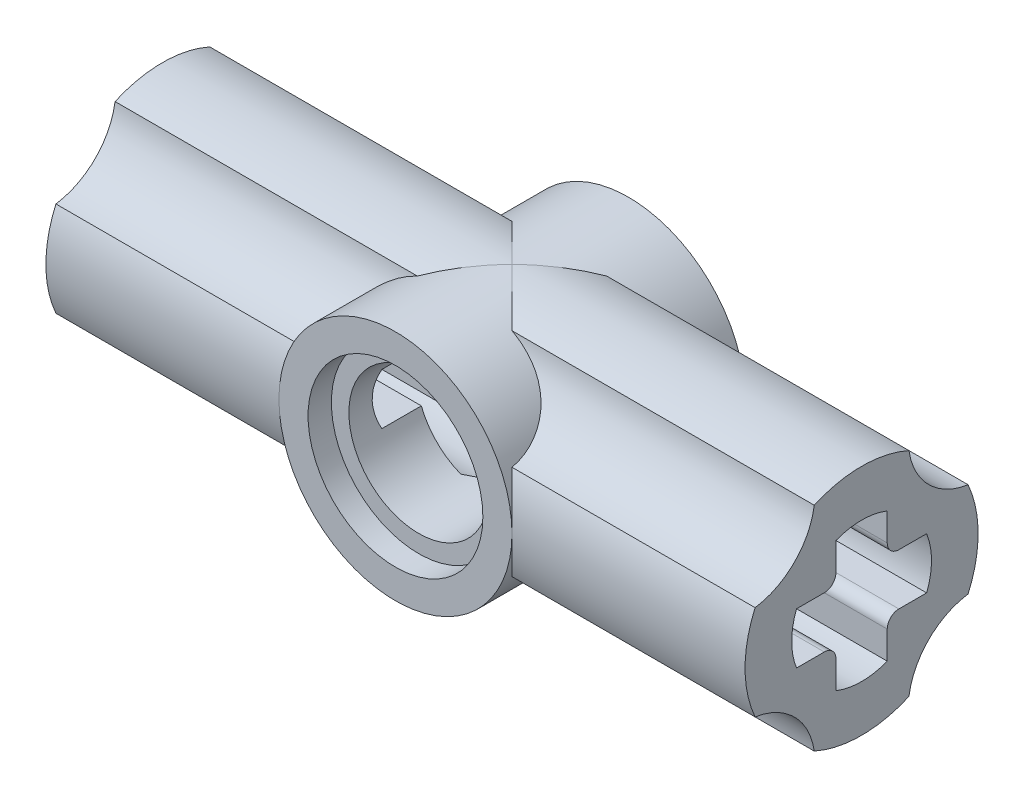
ISO-10303-21;
HEADER;
FILE_DESCRIPTION(('STEP AP214'),'2;1');
FILE_NAME('part.step','',(''),(''),'','','');
FILE_SCHEMA(('AUTOMOTIVE_DESIGN { 1 0 10303 214 1 1 1 1 }'));
ENDSEC;
DATA;
#1=APPLICATION_CONTEXT('core data for automotive mechanical design processes');
#2=APPLICATION_PROTOCOL_DEFINITION('international standard','automotive_design',2000,#1);
#3=PRODUCT_CONTEXT('',#1,'mechanical');
#4=PRODUCT('Part','Part','',(#3));
#5=PRODUCT_RELATED_PRODUCT_CATEGORY('part','',(#4));
#6=PRODUCT_DEFINITION_FORMATION('','',#4);
#7=PRODUCT_DEFINITION_CONTEXT('part definition',#1,'design');
#8=PRODUCT_DEFINITION('design','',#6,#7);
#9=PRODUCT_DEFINITION_SHAPE('','',#8);
#10=(LENGTH_UNIT() NAMED_UNIT(*) SI_UNIT(.MILLI.,.METRE.));
#11=(NAMED_UNIT(*) PLANE_ANGLE_UNIT() SI_UNIT($,.RADIAN.));
#12=(NAMED_UNIT(*) SI_UNIT($,.STERADIAN.) SOLID_ANGLE_UNIT());
#13=UNCERTAINTY_MEASURE_WITH_UNIT(LENGTH_MEASURE(1.E-05),#10,'distance_accuracy_value','');
#14=(GEOMETRIC_REPRESENTATION_CONTEXT(3) GLOBAL_UNCERTAINTY_ASSIGNED_CONTEXT((#13)) GLOBAL_UNIT_ASSIGNED_CONTEXT((#10,
#11,#12)) REPRESENTATION_CONTEXT('',''));
#15=CARTESIAN_POINT('',(0.,0.,0.));
#16=DIRECTION('',(0.,0.,1.));
#17=DIRECTION('',(1.,0.,0.));
#18=AXIS2_PLACEMENT_3D('',#15,#16,#17);
#19=CARTESIAN_POINT('',(-12.,0.,-4.));
#20=DIRECTION('',(0.,0.,1.));
#21=DIRECTION('',(1.,0.,0.));
#22=AXIS2_PLACEMENT_3D('',#19,#20,#21);
#23=CYLINDRICAL_SURFACE('',#22,4.);
#24=CARTESIAN_POINT('',(-12.,0.,0.88));
#25=DIRECTION('',(0.,0.,1.));
#26=DIRECTION('',(0.,-1.,0.));
#27=AXIS2_PLACEMENT_3D('',#24,#25,#26);
#28=CIRCLE('',#27,4.);
#29=CARTESIAN_POINT('',(-8.21032982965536,-1.28,0.88));
#30=VERTEX_POINT('',#29);
#31=CARTESIAN_POINT('',(-8.0980005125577,-0.88,0.88));
#32=VERTEX_POINT('',#31);
#33=EDGE_CURVE('P0_E439',#30,#32,#28,.T.);
#34=ORIENTED_EDGE('',*,*,#33,.T.);
#35=DIRECTION('',(0.,0.,1.));
#36=VECTOR('',#35,1.);
#37=CARTESIAN_POINT('',(-8.0980005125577,-0.88,-4.));
#38=LINE('',#37,#36);
#39=CARTESIAN_POINT('',(-8.0980005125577,-0.88,1.28));
#40=VERTEX_POINT('',#39);
#41=EDGE_CURVE('P0_E470',#32,#40,#38,.T.);
#42=ORIENTED_EDGE('',*,*,#41,.T.);
#43=CARTESIAN_POINT('',(-8.09800051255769,-0.88,1.28));
#44=CARTESIAN_POINT('',(-8.09800109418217,-0.879978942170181,1.25795239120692));
#45=CARTESIAN_POINT('',(-8.09841139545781,-0.881821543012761,1.23591233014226));
#46=CARTESIAN_POINT('',(-8.10005549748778,-0.88907685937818,1.19248720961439));
#47=CARTESIAN_POINT('',(-8.10128824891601,-0.894485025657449,1.17110135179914));
#48=CARTESIAN_POINT('',(-8.1045818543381,-0.908717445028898,1.12955813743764));
#49=CARTESIAN_POINT('',(-8.10664299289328,-0.917542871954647,1.10940120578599));
#50=CARTESIAN_POINT('',(-8.11159700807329,-0.938315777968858,1.07088184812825));
#51=CARTESIAN_POINT('',(-8.11448983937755,-0.950263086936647,1.0525193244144));
#52=CARTESIAN_POINT('',(-8.12112528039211,-0.976995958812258,1.01795140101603));
#53=CARTESIAN_POINT('',(-8.12487386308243,-0.991801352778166,1.00176249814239));
#54=CARTESIAN_POINT('',(-8.13318540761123,-1.02372680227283,0.972105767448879));
#55=CARTESIAN_POINT('',(-8.13774847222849,-1.04084714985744,0.958638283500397));
#56=CARTESIAN_POINT('',(-8.147753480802,-1.07729355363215,0.934457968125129));
#57=CARTESIAN_POINT('',(-8.15321310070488,-1.0966610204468,0.923814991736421));
#58=CARTESIAN_POINT('',(-8.16485376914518,-1.13670043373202,0.905906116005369));
#59=CARTESIAN_POINT('',(-8.17103494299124,-1.15737260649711,0.89864080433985));
#60=CARTESIAN_POINT('',(-8.1826587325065,-1.19507729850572,0.888738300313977));
#61=CARTESIAN_POINT('',(-8.18798978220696,-1.21197855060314,0.885454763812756));
#62=CARTESIAN_POINT('',(-8.19895104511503,-1.24593316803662,0.881085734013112));
#63=CARTESIAN_POINT('',(-8.2045806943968,-1.26298619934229,0.879996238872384));
#64=CARTESIAN_POINT('',(-8.21032982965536,-1.28,0.88));
#65=B_SPLINE_CURVE_WITH_KNOTS('',3,(#43,#44,#45,#46,#47,#48,#49,#50,#51,#52,#53,#54,#55,#56,#57,
#58,#59,#60,#61,#62,#63,#64),.UNSPECIFIED.,.F.,.F.,(4,2,2,2,2,2,2,2,2,2,4),(0.,
0.0660509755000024,0.132017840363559,0.198007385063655,0.263993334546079,0.330454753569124,
0.396924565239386,0.464910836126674,0.5329089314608,0.586846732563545,0.640686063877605),.UNSPECIFIED.);
#66=EDGE_CURVE('P0_E11',#40,#30,#65,.T.);
#67=ORIENTED_EDGE('',*,*,#66,.T.);
#68=EDGE_LOOP('',(#34,#42,#67));
#69=FACE_BOUND('',#68,.T.);
#70=ADVANCED_FACE('P0_F45',(#69),#23,.T.);
#71=DIRECTION('',(0.,0.,1.));
#72=VECTOR('',#71,1.);
#73=CARTESIAN_POINT('',(-8.0980005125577,0.880000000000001,-4.));
#74=LINE('',#73,#72);
#75=CARTESIAN_POINT('',(-8.0980005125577,0.880000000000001,1.28));
#76=VERTEX_POINT('',#75);
#77=CARTESIAN_POINT('',(-8.0980005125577,0.880000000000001,0.88));
#78=VERTEX_POINT('',#77);
#79=EDGE_CURVE('P0_E473',#76,#78,#74,.F.);
#80=ORIENTED_EDGE('',*,*,#79,.T.);
#81=CARTESIAN_POINT('',(-12.,0.,0.88));
#82=DIRECTION('',(0.,0.,1.));
#83=DIRECTION('',(0.,-1.,0.));
#84=AXIS2_PLACEMENT_3D('',#81,#82,#83);
#85=CIRCLE('',#84,4.);
#86=CARTESIAN_POINT('',(-8.21032982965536,1.28,0.88));
#87=VERTEX_POINT('',#86);
#88=EDGE_CURVE('P0_E477',#78,#87,#85,.T.);
#89=ORIENTED_EDGE('',*,*,#88,.T.);
#90=CARTESIAN_POINT('',(-8.21032982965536,1.28,0.88));
#91=CARTESIAN_POINT('',(-8.20260598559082,1.25715882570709,0.879981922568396));
#92=CARTESIAN_POINT('',(-8.19510104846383,1.23423188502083,0.881956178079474));
#93=CARTESIAN_POINT('',(-8.18068221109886,1.18884860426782,0.889847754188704));
#94=CARTESIAN_POINT('',(-8.17376898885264,1.16639282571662,0.895769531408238));
#95=CARTESIAN_POINT('',(-8.16069442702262,1.12261326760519,0.911527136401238));
#96=CARTESIAN_POINT('',(-8.15453432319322,1.10129138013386,0.92136928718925));
#97=CARTESIAN_POINT('',(-8.14309758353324,1.06054250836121,0.944754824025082));
#98=CARTESIAN_POINT('',(-8.13782017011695,1.04111386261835,0.95829492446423));
#99=CARTESIAN_POINT('',(-8.1283856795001,1.00545115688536,0.988202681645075));
#100=CARTESIAN_POINT('',(-8.12419599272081,0.989129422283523,1.00445547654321));
#101=CARTESIAN_POINT('',(-8.11673767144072,0.95943148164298,1.03965477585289));
#102=CARTESIAN_POINT('',(-8.11346921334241,0.9460558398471,1.05860179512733));
#103=CARTESIAN_POINT('',(-8.10796359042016,0.923139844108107,1.09792576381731));
#104=CARTESIAN_POINT('',(-8.10569455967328,0.913482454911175,1.11823022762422));
#105=CARTESIAN_POINT('',(-8.10202480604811,0.897694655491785,1.16023064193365));
#106=CARTESIAN_POINT('',(-8.10062323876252,0.891560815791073,1.18192521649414));
#107=CARTESIAN_POINT('',(-8.09910031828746,0.884865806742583,1.21650060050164));
#108=CARTESIAN_POINT('',(-8.09868746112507,0.883041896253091,1.22913769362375));
#109=CARTESIAN_POINT('',(-8.09813795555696,0.880609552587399,1.2545145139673));
#110=CARTESIAN_POINT('',(-8.09800088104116,0.879999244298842,1.26725405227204));
#111=CARTESIAN_POINT('',(-8.0980005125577,0.88,1.28));
#112=B_SPLINE_CURVE_WITH_KNOTS('',3,(#90,#91,#92,#93,#94,#95,#96,#97,#98,#99,#100,#101,#102,
#103,#104,#105,#106,#107,#108,#109,#110,#111),.UNSPECIFIED.,.F.,.F.,(4,2,2,2,2,2,2,2,2,2,4),(0.,
0.0722708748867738,0.144623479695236,0.217093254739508,0.289498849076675,0.359383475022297,
0.429281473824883,0.496752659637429,0.564158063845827,0.602427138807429,0.640637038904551),.UNSPECIFIED.);
#113=EDGE_CURVE('P0_E903',#87,#76,#112,.T.);
#114=ORIENTED_EDGE('',*,*,#113,.T.);
#115=EDGE_LOOP('',(#80,#89,#114));
#116=FACE_BOUND('',#115,.T.);
#117=ADVANCED_FACE('P0_F670',(#116),#23,.T.);
#118=CARTESIAN_POINT('',(-12.,0.,-0.88));
#119=DIRECTION('',(0.,0.,-1.));
#120=DIRECTION('',(0.,1.,0.));
#121=AXIS2_PLACEMENT_3D('',#118,#119,#120);
#122=CIRCLE('',#121,4.);
#123=CARTESIAN_POINT('',(-8.21032982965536,1.28,-0.88));
#124=VERTEX_POINT('',#123);
#125=CARTESIAN_POINT('',(-8.0980005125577,0.88,-0.88));
#126=VERTEX_POINT('',#125);
#127=EDGE_CURVE('P0_E480',#124,#126,#122,.T.);
#128=ORIENTED_EDGE('',*,*,#127,.T.);
#129=DIRECTION('',(0.,0.,1.));
#130=VECTOR('',#129,1.);
#131=CARTESIAN_POINT('',(-8.0980005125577,0.879999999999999,-4.));
#132=LINE('',#131,#130);
#133=CARTESIAN_POINT('',(-8.0980005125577,0.879999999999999,-1.28));
#134=VERTEX_POINT('',#133);
#135=EDGE_CURVE('P0_E484',#126,#134,#132,.F.);
#136=ORIENTED_EDGE('',*,*,#135,.T.);
#137=CARTESIAN_POINT('',(-8.09800051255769,0.88,-1.28));
#138=CARTESIAN_POINT('',(-8.09800109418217,0.879978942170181,-1.25795239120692));
#139=CARTESIAN_POINT('',(-8.09841139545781,0.881821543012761,-1.23591233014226));
#140=CARTESIAN_POINT('',(-8.10005549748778,0.88907685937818,-1.19248720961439));
#141=CARTESIAN_POINT('',(-8.10128824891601,0.894485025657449,-1.17110135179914));
#142=CARTESIAN_POINT('',(-8.1045818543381,0.908717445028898,-1.12955813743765));
#143=CARTESIAN_POINT('',(-8.10664299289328,0.917542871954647,-1.10940120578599));
#144=CARTESIAN_POINT('',(-8.11159700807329,0.938315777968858,-1.07088184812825));
#145=CARTESIAN_POINT('',(-8.11448983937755,0.950263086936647,-1.0525193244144));
#146=CARTESIAN_POINT('',(-8.12112528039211,0.976995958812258,-1.01795140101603));
#147=CARTESIAN_POINT('',(-8.12487386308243,0.991801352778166,-1.00176249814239));
#148=CARTESIAN_POINT('',(-8.13318540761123,1.02372680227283,-0.97210576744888));
#149=CARTESIAN_POINT('',(-8.13774847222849,1.04084714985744,-0.958638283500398));
#150=CARTESIAN_POINT('',(-8.147753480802,1.07729355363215,-0.934457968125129));
#151=CARTESIAN_POINT('',(-8.15321310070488,1.0966610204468,-0.923814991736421));
#152=CARTESIAN_POINT('',(-8.16485376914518,1.13670043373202,-0.905906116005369));
#153=CARTESIAN_POINT('',(-8.17103494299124,1.15737260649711,-0.898640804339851));
#154=CARTESIAN_POINT('',(-8.1826587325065,1.19507729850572,-0.888738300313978));
#155=CARTESIAN_POINT('',(-8.18798978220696,1.21197855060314,-0.885454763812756));
#156=CARTESIAN_POINT('',(-8.19895104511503,1.24593316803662,-0.881085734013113));
#157=CARTESIAN_POINT('',(-8.2045806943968,1.26298619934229,-0.879996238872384));
#158=CARTESIAN_POINT('',(-8.21032982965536,1.28,-0.88));
#159=B_SPLINE_CURVE_WITH_KNOTS('',3,(#137,#138,#139,#140,#141,#142,#143,#144,#145,#146,#147,
#148,#149,#150,#151,#152,#153,#154,#155,#156,#157,#158),.UNSPECIFIED.,.F.,.F.,(4,2,2,2,2,2,2,2,
2,2,4),(0.,0.0660509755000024,0.132017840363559,0.198007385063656,0.263993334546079,
0.330454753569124,0.396924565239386,0.464910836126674,0.5329089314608,0.586846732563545,
0.640686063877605),.UNSPECIFIED.);
#160=EDGE_CURVE('P0_E708',#134,#124,#159,.T.);
#161=ORIENTED_EDGE('',*,*,#160,.T.);
#162=EDGE_LOOP('',(#128,#136,#161));
#163=FACE_BOUND('',#162,.T.);
#164=ADVANCED_FACE('P0_F676',(#163),#23,.T.);
#165=CARTESIAN_POINT('',(-12.,0.,-4.));
#166=DIRECTION('',(0.,0.,1.));
#167=DIRECTION('',(1.,0.,0.));
#168=AXIS2_PLACEMENT_3D('',#165,#166,#167);
#169=CYLINDRICAL_SURFACE('',#168,2.4);
#170=CARTESIAN_POINT('',(-12.,0.,-3.2));
#171=DIRECTION('',(0.,0.,1.));
#172=DIRECTION('',(1.,0.,0.));
#173=AXIS2_PLACEMENT_3D('',#170,#171,#172);
#174=CIRCLE('',#173,2.4);
#175=CARTESIAN_POINT('',(-9.6,0.,-3.2));
#176=VERTEX_POINT('',#175);
#177=EDGE_CURVE('P0_E1535',#176,#176,#174,.T.);
#178=ORIENTED_EDGE('',*,*,#177,.F.);
#179=EDGE_LOOP('',(#178));
#180=FACE_BOUND('',#179,.T.);
#181=CARTESIAN_POINT('',(-12.,0.,-0.88));
#182=DIRECTION('',(0.,0.,-1.));
#183=DIRECTION('',(0.,1.,0.));
#184=AXIS2_PLACEMENT_3D('',#181,#182,#183);
#185=CIRCLE('',#184,2.4);
#186=CARTESIAN_POINT('',(-14.2328457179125,-0.88,-0.88));
#187=VERTEX_POINT('',#186);
#188=CARTESIAN_POINT('',(-12.88,-2.23284571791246,-0.88));
#189=VERTEX_POINT('',#188);
#190=EDGE_CURVE('P0_E508',#187,#189,#185,.F.);
#191=ORIENTED_EDGE('',*,*,#190,.T.);
#192=CARTESIAN_POINT('',(-12.,0.,0.));
#193=DIRECTION('',(-0.707106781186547,0.,0.707106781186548));
#194=DIRECTION('',(0.707106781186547,0.,0.707106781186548));
#195=AXIS2_PLACEMENT_3D('',#192,#193,#194);
#196=ELLIPSE('',#195,3.39411254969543,2.4);
#197=CARTESIAN_POINT('',(-12.,-2.4,0.));
#198=VERTEX_POINT('',#197);
#199=EDGE_CURVE('P0_E499',#189,#198,#196,.T.);
#200=ORIENTED_EDGE('',*,*,#199,.T.);
#201=CARTESIAN_POINT('',(-12.,0.,0.));
#202=DIRECTION('',(0.707106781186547,0.,0.707106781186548));
#203=DIRECTION('',(-0.707106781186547,0.,0.707106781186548));
#204=AXIS2_PLACEMENT_3D('',#201,#202,#203);
#205=ELLIPSE('',#204,3.39411254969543,2.4);
#206=CARTESIAN_POINT('',(-11.12,-2.23284571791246,-0.88));
#207=VERTEX_POINT('',#206);
#208=EDGE_CURVE('P0_E496',#198,#207,#205,.T.);
#209=ORIENTED_EDGE('',*,*,#208,.T.);
#210=CARTESIAN_POINT('',(-9.76715428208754,-0.88,-0.88));
#211=VERTEX_POINT('',#210);
#212=EDGE_CURVE('P0_E505',#207,#211,#185,.F.);
#213=ORIENTED_EDGE('',*,*,#212,.T.);
#214=DIRECTION('',(0.,0.,1.));
#215=VECTOR('',#214,1.);
#216=CARTESIAN_POINT('',(-9.76715428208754,-0.88,-4.));
#217=LINE('',#216,#215);
#218=CARTESIAN_POINT('',(-9.76715428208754,-0.88,-2.23284571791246));
#219=VERTEX_POINT('',#218);
#220=EDGE_CURVE('P0_E512',#211,#219,#217,.F.);
#221=ORIENTED_EDGE('',*,*,#220,.T.);
#222=CARTESIAN_POINT('',(-12.,0.,0.));
#223=DIRECTION('',(0.707106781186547,0.,0.707106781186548));
#224=DIRECTION('',(-0.707106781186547,0.,0.707106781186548));
#225=AXIS2_PLACEMENT_3D('',#222,#223,#224);
#226=ELLIPSE('',#225,3.39411254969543,2.4);
#227=CARTESIAN_POINT('',(-9.76715428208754,0.88,-2.23284571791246));
#228=VERTEX_POINT('',#227);
#229=EDGE_CURVE('P0_E515',#219,#228,#226,.T.);
#230=ORIENTED_EDGE('',*,*,#229,.T.);
#231=DIRECTION('',(0.,0.,1.));
#232=VECTOR('',#231,1.);
#233=CARTESIAN_POINT('',(-9.76715428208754,0.879999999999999,-4.));
#234=LINE('',#233,#232);
#235=CARTESIAN_POINT('',(-9.76715428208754,0.88,-0.88));
#236=VERTEX_POINT('',#235);
#237=EDGE_CURVE('P0_E521',#228,#236,#234,.T.);
#238=ORIENTED_EDGE('',*,*,#237,.T.);
#239=CARTESIAN_POINT('',(-12.,0.,-0.88));
#240=DIRECTION('',(0.,0.,-1.));
#241=DIRECTION('',(0.,1.,0.));
#242=AXIS2_PLACEMENT_3D('',#239,#240,#241);
#243=CIRCLE('',#242,2.4);
#244=CARTESIAN_POINT('',(-11.12,2.23284571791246,-0.88));
#245=VERTEX_POINT('',#244);
#246=EDGE_CURVE('P0_E527',#236,#245,#243,.F.);
#247=ORIENTED_EDGE('',*,*,#246,.T.);
#248=CARTESIAN_POINT('',(-12.,0.,0.));
#249=DIRECTION('',(0.707106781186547,0.,0.707106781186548));
#250=DIRECTION('',(-0.707106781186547,0.,0.707106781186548));
#251=AXIS2_PLACEMENT_3D('',#248,#249,#250);
#252=ELLIPSE('',#251,3.39411254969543,2.4);
#253=CARTESIAN_POINT('',(-12.,2.4,0.));
#254=VERTEX_POINT('',#253);
#255=EDGE_CURVE('P0_E534',#245,#254,#252,.T.);
#256=ORIENTED_EDGE('',*,*,#255,.T.);
#257=CARTESIAN_POINT('',(-12.,0.,0.));
#258=DIRECTION('',(-0.707106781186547,0.,0.707106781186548));
#259=DIRECTION('',(0.707106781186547,0.,0.707106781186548));
#260=AXIS2_PLACEMENT_3D('',#257,#258,#259);
#261=ELLIPSE('',#260,3.39411254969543,2.4);
#262=CARTESIAN_POINT('',(-12.88,2.23284571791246,-0.88));
#263=VERTEX_POINT('',#262);
#264=EDGE_CURVE('P0_E66',#254,#263,#261,.T.);
#265=ORIENTED_EDGE('',*,*,#264,.T.);
#266=CARTESIAN_POINT('',(-14.2328457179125,0.88,-0.88));
#267=VERTEX_POINT('',#266);
#268=EDGE_CURVE('P0_E530',#263,#267,#243,.F.);
#269=ORIENTED_EDGE('',*,*,#268,.T.);
#270=DIRECTION('',(0.,0.,1.));
#271=VECTOR('',#270,1.);
#272=CARTESIAN_POINT('',(-14.2328457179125,0.879999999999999,-4.));
#273=LINE('',#272,#271);
#274=CARTESIAN_POINT('',(-14.2328457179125,0.88,-2.23284571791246));
#275=VERTEX_POINT('',#274);
#276=EDGE_CURVE('P0_E524',#267,#275,#273,.F.);
#277=ORIENTED_EDGE('',*,*,#276,.T.);
#278=CARTESIAN_POINT('',(-12.,0.,0.));
#279=DIRECTION('',(-0.707106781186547,0.,0.707106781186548));
#280=DIRECTION('',(0.707106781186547,0.,0.707106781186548));
#281=AXIS2_PLACEMENT_3D('',#278,#279,#280);
#282=ELLIPSE('',#281,3.39411254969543,2.4);
#283=CARTESIAN_POINT('',(-14.2328457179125,-0.88,-2.23284571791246));
#284=VERTEX_POINT('',#283);
#285=EDGE_CURVE('P0_E518',#275,#284,#282,.T.);
#286=ORIENTED_EDGE('',*,*,#285,.T.);
#287=DIRECTION('',(0.,0.,1.));
#288=VECTOR('',#287,1.);
#289=CARTESIAN_POINT('',(-14.2328457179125,-0.88,-4.));
#290=LINE('',#289,#288);
#291=EDGE_CURVE('P0_E509',#284,#187,#290,.T.);
#292=ORIENTED_EDGE('',*,*,#291,.T.);
#293=EDGE_LOOP('',(#191,#200,#209,#213,#221,#230,#238,#247,#256,#265,#269,#277,#286,#292));
#294=FACE_BOUND('',#293,.T.);
#295=ADVANCED_FACE('P0_F696',(#180,#294),#169,.F.);
#296=CARTESIAN_POINT('',(-12.,0.,-4.));
#297=DIRECTION('',(0.,0.,1.));
#298=DIRECTION('',(1.,0.,0.));
#299=AXIS2_PLACEMENT_3D('',#296,#297,#298);
#300=CYLINDRICAL_SURFACE('',#299,4.);
#301=CARTESIAN_POINT('',(-12.0000000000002,0.,0.));
#302=DIRECTION('',(-0.707106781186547,0.,0.707106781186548));
#303=DIRECTION('',(-0.707106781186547,0.,-0.707106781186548));
#304=AXIS2_PLACEMENT_3D('',#301,#302,#303);
#305=ELLIPSE('',#304,5.65685424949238,4.);
#306=CARTESIAN_POINT('',(-13.6249137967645,3.65508620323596,-1.62491379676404));
#307=VERTEX_POINT('',#306);
#308=CARTESIAN_POINT('',(-12.0000000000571,4.,0.));
#309=VERTEX_POINT('',#308);
#310=EDGE_CURVE('P0_E1506',#307,#309,#305,.F.);
#311=ORIENTED_EDGE('',*,*,#310,.T.);
#312=CARTESIAN_POINT('',(-12.0000000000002,0.,0.));
#313=DIRECTION('',(0.707106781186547,0.,0.707106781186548));
#314=DIRECTION('',(0.707106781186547,0.,-0.707106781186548));
#315=AXIS2_PLACEMENT_3D('',#312,#313,#314);
#316=ELLIPSE('',#315,5.65685424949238,4.);
#317=CARTESIAN_POINT('',(-10.3750862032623,3.65508620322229,-1.62491379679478));
#318=VERTEX_POINT('',#317);
#319=EDGE_CURVE('P0_E839',#309,#318,#316,.F.);
#320=ORIENTED_EDGE('',*,*,#319,.T.);
#321=CARTESIAN_POINT('',(-10.3750862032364,3.65508620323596,-1.62491379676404));
#322=CARTESIAN_POINT('',(-10.2823139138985,3.61387188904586,-1.63092923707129));
#323=CARTESIAN_POINT('',(-10.1911709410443,3.56909577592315,-1.6384992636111));
#324=CARTESIAN_POINT('',(-10.0126857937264,3.47287100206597,-1.65807936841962));
#325=CARTESIAN_POINT('',(-9.92535378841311,3.42140579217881,-1.67010060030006));
#326=CARTESIAN_POINT('',(-9.75492013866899,3.31209012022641,-1.7000001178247));
#327=CARTESIAN_POINT('',(-9.67185200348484,3.25419788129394,-1.7179184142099));
#328=CARTESIAN_POINT('',(-9.51161777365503,3.13337103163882,-1.76101246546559));
#329=CARTESIAN_POINT('',(-9.43444436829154,3.07044287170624,-1.78617903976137));
#330=CARTESIAN_POINT('',(-9.26343126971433,2.92025141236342,-1.85455544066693));
#331=CARTESIAN_POINT('',(-9.17204364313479,2.83158792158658,-1.90095472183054));
#332=CARTESIAN_POINT('',(-9.00335038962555,2.65238561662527,-2.01130610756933));
#333=CARTESIAN_POINT('',(-8.92598770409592,2.56185614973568,-2.07518430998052));
#334=CARTESIAN_POINT('',(-8.82101407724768,2.42844107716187,-2.1851770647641));
#335=CARTESIAN_POINT('',(-8.78775386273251,2.38418821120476,-2.22439555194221));
#336=CARTESIAN_POINT('',(-8.72509637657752,2.29735939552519,-2.30748194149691));
#337=CARTESIAN_POINT('',(-8.6956974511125,2.25478273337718,-2.35134783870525));
#338=CARTESIAN_POINT('',(-8.64070585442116,2.17200832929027,-2.44362830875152));
#339=CARTESIAN_POINT('',(-8.61511868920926,2.13181407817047,-2.49204929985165));
#340=CARTESIAN_POINT('',(-8.5677048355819,2.05460502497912,-2.59305777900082));
#341=CARTESIAN_POINT('',(-8.54587776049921,2.01758989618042,-2.64564483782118));
#342=CARTESIAN_POINT('',(-8.48962965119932,1.91902233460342,-2.79865941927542));
#343=CARTESIAN_POINT('',(-8.45926306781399,1.86177889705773,-2.90344215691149));
#344=CARTESIAN_POINT('',(-8.40905565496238,1.763013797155,-3.12233368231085));
#345=CARTESIAN_POINT('',(-8.38920111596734,1.72147167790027,-3.23643009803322));
#346=CARTESIAN_POINT('',(-8.3675178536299,1.67490117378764,-3.40287021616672));
#347=CARTESIAN_POINT('',(-8.36190160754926,1.6626424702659,-3.45281321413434));
#348=CARTESIAN_POINT('',(-8.35224853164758,1.64135387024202,-3.55343145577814));
#349=CARTESIAN_POINT('',(-8.34820866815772,1.6323177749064,-3.6041050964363));
#350=CARTESIAN_POINT('',(-8.34491379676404,1.62491379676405,-3.6550862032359));
#351=B_SPLINE_CURVE_WITH_KNOTS('',3,(#321,#322,#323,#324,#325,#326,#327,#328,#329,#330,#331,
#332,#333,#334,#335,#336,#337,#338,#339,#340,#341,#342,#343,#344,#345,#346,#347,#348,#349,#350),
.UNSPECIFIED.,.F.,.F.,(4,2,2,2,2,2,2,2,2,2,2,2,2,2,4),(0.,0.305068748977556,0.61090715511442,
0.918864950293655,1.22643439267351,1.63131432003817,2.0345081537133,2.23779057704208,
2.44098564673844,2.64447143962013,2.84793629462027,3.21562348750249,3.58282996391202,
3.73791688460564,3.89270385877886),.UNSPECIFIED.);
#352=CARTESIAN_POINT('',(-8.34491379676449,1.62491379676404,-3.65508620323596));
#353=VERTEX_POINT('',#352);
#354=EDGE_CURVE('P0_E832',#318,#353,#351,.T.);
#355=ORIENTED_EDGE('',*,*,#354,.T.);
#356=CARTESIAN_POINT('',(-12.0000000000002,0.,0.));
#357=DIRECTION('',(0.707106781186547,0.,0.707106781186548));
#358=DIRECTION('',(0.707106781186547,0.,-0.707106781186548));
#359=AXIS2_PLACEMENT_3D('',#356,#357,#358);
#360=ELLIPSE('',#359,5.65685424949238,4.);
#361=CARTESIAN_POINT('',(-8.,0.,-4.));
#362=VERTEX_POINT('',#361);
#363=EDGE_CURVE('P0_E840',#353,#362,#360,.F.);
#364=ORIENTED_EDGE('',*,*,#363,.T.);
#365=CARTESIAN_POINT('',(-12.,0.,-4.));
#366=DIRECTION('',(0.,0.,1.));
#367=DIRECTION('',(1.,0.,0.));
#368=AXIS2_PLACEMENT_3D('',#365,#366,#367);
#369=CIRCLE('',#368,4.);
#370=CARTESIAN_POINT('',(-16.,0.,-4.));
#371=VERTEX_POINT('',#370);
#372=EDGE_CURVE('P0_E871',#362,#371,#369,.T.);
#373=ORIENTED_EDGE('',*,*,#372,.T.);
#374=CARTESIAN_POINT('',(-12.0000000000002,0.,0.));
#375=DIRECTION('',(-0.707106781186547,0.,0.707106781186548));
#376=DIRECTION('',(-0.707106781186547,0.,-0.707106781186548));
#377=AXIS2_PLACEMENT_3D('',#374,#375,#376);
#378=ELLIPSE('',#377,5.65685424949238,4.);
#379=CARTESIAN_POINT('',(-15.6550862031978,1.62491379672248,-3.65508620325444));
#380=VERTEX_POINT('',#379);
#381=EDGE_CURVE('P0_E647',#371,#380,#378,.F.);
#382=ORIENTED_EDGE('',*,*,#381,.T.);
#383=CARTESIAN_POINT('',(-15.6550862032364,1.62491379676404,-3.65508620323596));
#384=CARTESIAN_POINT('',(-15.6511923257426,1.63365001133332,-3.5948657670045));
#385=CARTESIAN_POINT('',(-15.6462590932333,1.64468450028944,-3.53504696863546));
#386=CARTESIAN_POINT('',(-15.6341913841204,1.6711925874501,-3.41662458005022));
#387=CARTESIAN_POINT('',(-15.6270568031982,1.68666639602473,-3.3580210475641));
#388=CARTESIAN_POINT('',(-15.6104695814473,1.72188341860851,-3.24248433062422));
#389=CARTESIAN_POINT('',(-15.6010184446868,1.74162386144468,-3.18555008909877));
#390=CARTESIAN_POINT('',(-15.579650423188,1.78513025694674,-3.07373991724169));
#391=CARTESIAN_POINT('',(-15.5677336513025,1.8088960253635,-3.01886389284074));
#392=CARTESIAN_POINT('',(-15.5279962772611,1.88589257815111,-2.85777764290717));
#393=CARTESIAN_POINT('',(-15.4961947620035,1.94480861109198,-2.75515449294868));
#394=CARTESIAN_POINT('',(-15.4208314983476,2.07448831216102,-2.56268164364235));
#395=CARTESIAN_POINT('',(-15.3772777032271,2.14524395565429,-2.47282336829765));
#396=CARTESIAN_POINT('',(-15.2781854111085,2.29376630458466,-2.30858168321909));
#397=CARTESIAN_POINT('',(-15.2227769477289,2.37145199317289,-2.23404633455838));
#398=CARTESIAN_POINT('',(-15.099841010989,2.53002759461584,-2.10000614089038));
#399=CARTESIAN_POINT('',(-15.0323143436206,2.61091729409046,-2.04050029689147));
#400=CARTESIAN_POINT('',(-14.8825586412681,2.7755754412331,-1.93338471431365));
#401=CARTESIAN_POINT('',(-14.7997828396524,2.85929767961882,-1.88647591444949));
#402=CARTESIAN_POINT('',(-14.6233175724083,3.02202717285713,-1.80641185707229));
#403=CARTESIAN_POINT('',(-14.5296025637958,3.10102271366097,-1.77328964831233));
#404=CARTESIAN_POINT('',(-14.3699996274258,3.22321618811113,-1.72863096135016));
#405=CARTESIAN_POINT('',(-14.30680175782,3.26875895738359,-1.71365358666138));
#406=CARTESIAN_POINT('',(-14.1772811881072,3.3564202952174,-1.68744785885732));
#407=CARTESIAN_POINT('',(-14.1109571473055,3.39853737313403,-1.67622113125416));
#408=CARTESIAN_POINT('',(-13.9759589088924,3.47875259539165,-1.65692530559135));
#409=CARTESIAN_POINT('',(-13.9072983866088,3.51687009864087,-1.64884043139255));
#410=CARTESIAN_POINT('',(-13.7677237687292,3.58905785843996,-1.63516177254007));
#411=CARTESIAN_POINT('',(-13.6968119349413,3.62313202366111,-1.62956556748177));
#412=CARTESIAN_POINT('',(-13.6249137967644,3.65508620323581,-1.62491379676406));
#413=B_SPLINE_CURVE_WITH_KNOTS('',3,(#383,#384,#385,#386,#387,#388,#389,#390,#391,#392,#393,
#394,#395,#396,#397,#398,#399,#400,#401,#402,#403,#404,#405,#406,#407,#408,#409,#410,#411,#412),
.UNSPECIFIED.,.F.,.F.,(4,2,2,2,2,2,2,2,2,2,2,2,2,2,4),(0.,0.182870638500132,0.365749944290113,
0.548510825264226,0.731263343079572,1.09690984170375,1.46230950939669,1.82388969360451,
2.18544583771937,2.56420913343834,2.9438752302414,3.18164590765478,3.41951950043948,
3.65618273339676,3.89261528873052),.UNSPECIFIED.);
#414=EDGE_CURVE('P0_E1562',#380,#307,#413,.T.);
#415=ORIENTED_EDGE('',*,*,#414,.T.);
#416=EDGE_LOOP('',(#311,#320,#355,#364,#373,#382,#415));
#417=FACE_BOUND('',#416,.T.);
#418=ADVANCED_FACE('P0_F701',(#417),#300,.T.);
#419=CARTESIAN_POINT('',(-12.0000000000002,0.,0.));
#420=DIRECTION('',(-0.707106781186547,0.,-0.707106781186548));
#421=DIRECTION('',(-0.707106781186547,0.,0.707106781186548));
#422=AXIS2_PLACEMENT_3D('',#419,#420,#421);
#423=ELLIPSE('',#422,5.65685424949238,4.);
#424=CARTESIAN_POINT('',(-13.6249137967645,3.65508620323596,1.62491379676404));
#425=VERTEX_POINT('',#424);
#426=EDGE_CURVE('P0_E615',#309,#425,#423,.F.);
#427=ORIENTED_EDGE('',*,*,#426,.T.);
#428=CARTESIAN_POINT('',(-13.6249137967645,3.65508620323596,1.62491379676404));
#429=CARTESIAN_POINT('',(-13.7176860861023,3.61387188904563,1.63092923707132));
#430=CARTESIAN_POINT('',(-13.8088290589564,3.56909577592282,1.63849926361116));
#431=CARTESIAN_POINT('',(-13.9873142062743,3.47287100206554,1.65807936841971));
#432=CARTESIAN_POINT('',(-14.0746462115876,3.42140579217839,1.67010060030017));
#433=CARTESIAN_POINT('',(-14.2450798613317,3.31209012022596,1.70000011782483));
#434=CARTESIAN_POINT('',(-14.3281479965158,3.25419788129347,1.71791841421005));
#435=CARTESIAN_POINT('',(-14.4883822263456,3.13337103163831,1.76101246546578));
#436=CARTESIAN_POINT('',(-14.5655556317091,3.07044287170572,1.78617903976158));
#437=CARTESIAN_POINT('',(-14.7365687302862,2.92025141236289,1.8545554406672));
#438=CARTESIAN_POINT('',(-14.8279563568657,2.83158792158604,1.90095472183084));
#439=CARTESIAN_POINT('',(-14.9966496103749,2.65238561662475,2.01130610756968));
#440=CARTESIAN_POINT('',(-15.0740122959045,2.56185614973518,2.0751843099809));
#441=CARTESIAN_POINT('',(-15.1789859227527,2.42844107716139,2.18517706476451));
#442=CARTESIAN_POINT('',(-15.2122461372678,2.38418821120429,2.22439555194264));
#443=CARTESIAN_POINT('',(-15.2749036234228,2.29735939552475,2.30748194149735));
#444=CARTESIAN_POINT('',(-15.3043025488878,2.25478273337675,2.3513478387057));
#445=CARTESIAN_POINT('',(-15.3592941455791,2.17200832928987,2.44362830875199));
#446=CARTESIAN_POINT('',(-15.384881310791,2.13181407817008,2.49204929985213));
#447=CARTESIAN_POINT('',(-15.4322951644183,2.05460502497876,2.59305777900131));
#448=CARTESIAN_POINT('',(-15.454122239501,2.01758989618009,2.64564483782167));
#449=CARTESIAN_POINT('',(-15.5103703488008,1.91902233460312,2.79865941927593));
#450=CARTESIAN_POINT('',(-15.5407369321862,1.86177889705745,2.90344215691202));
#451=CARTESIAN_POINT('',(-15.5909443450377,1.76301379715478,3.12233368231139));
#452=CARTESIAN_POINT('',(-15.6107988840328,1.72147167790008,3.23643009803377));
#453=CARTESIAN_POINT('',(-15.6324821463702,1.67490117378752,3.4028702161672));
#454=CARTESIAN_POINT('',(-15.6380983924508,1.6626424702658,3.45281321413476));
#455=CARTESIAN_POINT('',(-15.6477514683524,1.64135387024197,3.55343145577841));
#456=CARTESIAN_POINT('',(-15.6517913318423,1.63231777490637,3.60410509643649));
#457=CARTESIAN_POINT('',(-15.655086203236,1.62491379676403,3.65508620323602));
#458=B_SPLINE_CURVE_WITH_KNOTS('',3,(#428,#429,#430,#431,#432,#433,#434,#435,#436,#437,#438,
#439,#440,#441,#442,#443,#444,#445,#446,#447,#448,#449,#450,#451,#452,#453,#454,#455,#456,#457),
.UNSPECIFIED.,.F.,.F.,(4,2,2,2,2,2,2,2,2,2,2,2,2,2,4),(0.,0.305068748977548,0.610907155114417,
0.918864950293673,1.22643439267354,1.63131432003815,2.03450815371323,2.23779057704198,
2.4409856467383,2.64447143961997,2.84793629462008,3.21562348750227,3.5828299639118,
3.73791688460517,3.89270385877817),.UNSPECIFIED.);
#459=CARTESIAN_POINT('',(-15.6550862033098,1.62491379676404,3.65508620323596));
#460=VERTEX_POINT('',#459);
#461=EDGE_CURVE('P0_E607',#425,#460,#458,.T.);
#462=ORIENTED_EDGE('',*,*,#461,.T.);
#463=CARTESIAN_POINT('',(-12.0000000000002,0.,0.));
#464=DIRECTION('',(-0.707106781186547,0.,-0.707106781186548));
#465=DIRECTION('',(-0.707106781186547,0.,0.707106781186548));
#466=AXIS2_PLACEMENT_3D('',#463,#464,#465);
#467=ELLIPSE('',#466,5.65685424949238,4.);
#468=CARTESIAN_POINT('',(-16.,0.,4.));
#469=VERTEX_POINT('',#468);
#470=EDGE_CURVE('P0_E1529',#460,#469,#467,.F.);
#471=ORIENTED_EDGE('',*,*,#470,.T.);
#472=CARTESIAN_POINT('',(-12.,0.,4.));
#473=DIRECTION('',(0.,0.,1.));
#474=DIRECTION('',(1.,0.,0.));
#475=AXIS2_PLACEMENT_3D('',#472,#473,#474);
#476=CIRCLE('',#475,4.);
#477=CARTESIAN_POINT('',(-8.,0.,4.));
#478=VERTEX_POINT('',#477);
#479=EDGE_CURVE('P0_E867',#478,#469,#476,.T.);
#480=ORIENTED_EDGE('',*,*,#479,.F.);
#481=CARTESIAN_POINT('',(-12.0000000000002,0.,0.));
#482=DIRECTION('',(0.707106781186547,0.,-0.707106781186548));
#483=DIRECTION('',(0.707106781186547,0.,0.707106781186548));
#484=AXIS2_PLACEMENT_3D('',#481,#482,#483);
#485=ELLIPSE('',#484,5.65685424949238,4.);
#486=CARTESIAN_POINT('',(-8.34491379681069,1.62491379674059,3.65508620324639));
#487=VERTEX_POINT('',#486);
#488=EDGE_CURVE('P0_E799',#478,#487,#485,.F.);
#489=ORIENTED_EDGE('',*,*,#488,.T.);
#490=CARTESIAN_POINT('',(-8.34491379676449,1.62491379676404,3.65508620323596));
#491=CARTESIAN_POINT('',(-8.34880767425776,1.63365001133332,3.59486576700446));
#492=CARTESIAN_POINT('',(-8.35374090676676,1.64468450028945,3.5350469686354));
#493=CARTESIAN_POINT('',(-8.3658086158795,1.67119258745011,3.41662458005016));
#494=CARTESIAN_POINT('',(-8.37294319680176,1.68666639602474,3.35802104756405));
#495=CARTESIAN_POINT('',(-8.38953041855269,1.72188341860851,3.2424843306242));
#496=CARTESIAN_POINT('',(-8.39898155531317,1.74162386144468,3.18555008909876));
#497=CARTESIAN_POINT('',(-8.42034957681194,1.78513025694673,3.07373991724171));
#498=CARTESIAN_POINT('',(-8.43226634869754,1.80889602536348,3.01886389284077));
#499=CARTESIAN_POINT('',(-8.47200372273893,1.88589257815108,2.85777764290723));
#500=CARTESIAN_POINT('',(-8.50380523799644,1.94480861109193,2.75515449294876));
#501=CARTESIAN_POINT('',(-8.57916850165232,2.07448831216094,2.56268164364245));
#502=CARTESIAN_POINT('',(-8.62272229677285,2.1452439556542,2.47282336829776));
#503=CARTESIAN_POINT('',(-8.72181458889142,2.29376630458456,2.3085816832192));
#504=CARTESIAN_POINT('',(-8.77722305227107,2.37145199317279,2.23404633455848));
#505=CARTESIAN_POINT('',(-8.90015898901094,2.53002759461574,2.10000614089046));
#506=CARTESIAN_POINT('',(-8.96768565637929,2.61091729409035,2.04050029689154));
#507=CARTESIAN_POINT('',(-9.11744135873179,2.77557544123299,1.93338471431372));
#508=CARTESIAN_POINT('',(-9.20021716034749,2.8592976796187,1.88647591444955));
#509=CARTESIAN_POINT('',(-9.37668242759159,3.02202717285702,1.80641185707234));
#510=CARTESIAN_POINT('',(-9.47039743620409,3.10102271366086,1.77328964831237));
#511=CARTESIAN_POINT('',(-9.63000037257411,3.22321618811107,1.72863096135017));
#512=CARTESIAN_POINT('',(-9.69319824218,3.26875895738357,1.71365358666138));
#513=CARTESIAN_POINT('',(-9.82271881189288,3.35642029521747,1.6874478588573));
#514=CARTESIAN_POINT('',(-9.88904285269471,3.39853737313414,1.67622113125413));
#515=CARTESIAN_POINT('',(-10.024041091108,3.47875259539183,1.65692530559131));
#516=CARTESIAN_POINT('',(-10.0927016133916,3.51687009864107,1.6488404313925));
#517=CARTESIAN_POINT('',(-10.2322762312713,3.58905785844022,1.63516177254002));
#518=CARTESIAN_POINT('',(-10.3031880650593,3.62313202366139,1.62956556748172));
#519=CARTESIAN_POINT('',(-10.3750862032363,3.65508620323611,1.62491379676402));
#520=B_SPLINE_CURVE_WITH_KNOTS('',3,(#490,#491,#492,#493,#494,#495,#496,#497,#498,#499,#500,
#501,#502,#503,#504,#505,#506,#507,#508,#509,#510,#511,#512,#513,#514,#515,#516,#517,#518,#519),
.UNSPECIFIED.,.F.,.F.,(4,2,2,2,2,2,2,2,2,2,2,2,2,2,4),(0.,0.182870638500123,0.365749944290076,
0.548510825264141,0.731263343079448,1.09690984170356,1.46230950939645,1.82388969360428,
2.18544583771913,2.56420913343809,2.94387523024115,3.18164590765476,3.41951950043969,
3.65618273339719,3.89261528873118),.UNSPECIFIED.);
#521=CARTESIAN_POINT('',(-10.3750862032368,3.65508620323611,1.62491379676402));
#522=VERTEX_POINT('',#521);
#523=EDGE_CURVE('P0_E800',#487,#522,#520,.T.);
#524=ORIENTED_EDGE('',*,*,#523,.T.);
#525=CARTESIAN_POINT('',(-12.0000000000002,0.,0.));
#526=DIRECTION('',(0.707106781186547,0.,-0.707106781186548));
#527=DIRECTION('',(0.707106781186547,0.,0.707106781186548));
#528=AXIS2_PLACEMENT_3D('',#525,#526,#527);
#529=ELLIPSE('',#528,5.65685424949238,4.);
#530=EDGE_CURVE('P0_E808',#522,#309,#529,.F.);
#531=ORIENTED_EDGE('',*,*,#530,.T.);
#532=EDGE_LOOP('',(#427,#462,#471,#480,#489,#524,#531));
#533=FACE_BOUND('',#532,.T.);
#534=ADVANCED_FACE('P0_F1372',(#533),#300,.T.);
#535=CARTESIAN_POINT('',(-15.6550862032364,-1.62491379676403,-3.65508620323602));
#536=VERTEX_POINT('',#535);
#537=EDGE_CURVE('P0_E649',#536,#371,#378,.F.);
#538=ORIENTED_EDGE('',*,*,#537,.T.);
#539=EDGE_CURVE('P0_E870',#371,#362,#369,.T.);
#540=ORIENTED_EDGE('',*,*,#539,.T.);
#541=CARTESIAN_POINT('',(-8.34491379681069,-1.62491379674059,-3.65508620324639));
#542=VERTEX_POINT('',#541);
#543=EDGE_CURVE('P0_E864',#362,#542,#360,.F.);
#544=ORIENTED_EDGE('',*,*,#543,.T.);
#545=CARTESIAN_POINT('',(-8.3449137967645,-1.62491379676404,-3.65508620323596));
#546=CARTESIAN_POINT('',(-8.34880767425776,-1.63365001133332,-3.59486576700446));
#547=CARTESIAN_POINT('',(-8.35374090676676,-1.64468450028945,-3.5350469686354));
#548=CARTESIAN_POINT('',(-8.3658086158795,-1.67119258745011,-3.41662458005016));
#549=CARTESIAN_POINT('',(-8.37294319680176,-1.68666639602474,-3.35802104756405));
#550=CARTESIAN_POINT('',(-8.38953041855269,-1.72188341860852,-3.2424843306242));
#551=CARTESIAN_POINT('',(-8.39898155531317,-1.74162386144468,-3.18555008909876));
#552=CARTESIAN_POINT('',(-8.42034957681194,-1.78513025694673,-3.07373991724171));
#553=CARTESIAN_POINT('',(-8.43226634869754,-1.80889602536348,-3.01886389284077));
#554=CARTESIAN_POINT('',(-8.47200372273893,-1.88589257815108,-2.85777764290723));
#555=CARTESIAN_POINT('',(-8.50380523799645,-1.94480861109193,-2.75515449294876));
#556=CARTESIAN_POINT('',(-8.57916850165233,-2.07448831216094,-2.56268164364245));
#557=CARTESIAN_POINT('',(-8.62272229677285,-2.1452439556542,-2.47282336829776));
#558=CARTESIAN_POINT('',(-8.72181458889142,-2.29376630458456,-2.3085816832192));
#559=CARTESIAN_POINT('',(-8.77722305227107,-2.37145199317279,-2.23404633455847));
#560=CARTESIAN_POINT('',(-8.90015898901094,-2.53002759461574,-2.10000614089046));
#561=CARTESIAN_POINT('',(-8.96768565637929,-2.61091729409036,-2.04050029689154));
#562=CARTESIAN_POINT('',(-9.11744135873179,-2.77557544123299,-1.93338471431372));
#563=CARTESIAN_POINT('',(-9.2002171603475,-2.85929767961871,-1.88647591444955));
#564=CARTESIAN_POINT('',(-9.37668242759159,-3.02202717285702,-1.80641185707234));
#565=CARTESIAN_POINT('',(-9.4703974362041,-3.10102271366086,-1.77328964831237));
#566=CARTESIAN_POINT('',(-9.63000037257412,-3.22321618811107,-1.72863096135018));
#567=CARTESIAN_POINT('',(-9.69319824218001,-3.26875895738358,-1.71365358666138));
#568=CARTESIAN_POINT('',(-9.82271881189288,-3.35642029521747,-1.6874478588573));
#569=CARTESIAN_POINT('',(-9.88904285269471,-3.39853737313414,-1.67622113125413));
#570=CARTESIAN_POINT('',(-10.024041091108,-3.47875259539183,-1.65692530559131));
#571=CARTESIAN_POINT('',(-10.0927016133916,-3.51687009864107,-1.6488404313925));
#572=CARTESIAN_POINT('',(-10.2322762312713,-3.58905785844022,-1.63516177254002));
#573=CARTESIAN_POINT('',(-10.3031880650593,-3.62313202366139,-1.62956556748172));
#574=CARTESIAN_POINT('',(-10.3750862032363,-3.65508620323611,-1.62491379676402));
#575=B_SPLINE_CURVE_WITH_KNOTS('',3,(#545,#546,#547,#548,#549,#550,#551,#552,#553,#554,#555,
#556,#557,#558,#559,#560,#561,#562,#563,#564,#565,#566,#567,#568,#569,#570,#571,#572,#573,#574),
.UNSPECIFIED.,.F.,.F.,(4,2,2,2,2,2,2,2,2,2,2,2,2,2,4),(0.,0.182870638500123,0.365749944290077,
0.548510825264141,0.731263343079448,1.09690984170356,1.46230950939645,1.82388969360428,
2.18544583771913,2.56420913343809,2.94387523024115,3.18164590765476,3.41951950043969,
3.65618273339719,3.89261528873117),.UNSPECIFIED.);
#576=CARTESIAN_POINT('',(-10.3750862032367,-3.65508620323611,-1.62491379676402));
#577=VERTEX_POINT('',#576);
#578=EDGE_CURVE('P0_E857',#542,#577,#575,.T.);
#579=ORIENTED_EDGE('',*,*,#578,.T.);
#580=CARTESIAN_POINT('',(-12.0000000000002,0.,0.));
#581=DIRECTION('',(0.707106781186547,0.,0.707106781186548));
#582=DIRECTION('',(0.707106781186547,0.,-0.707106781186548));
#583=AXIS2_PLACEMENT_3D('',#580,#581,#582);
#584=ELLIPSE('',#583,5.65685424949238,4.);
#585=CARTESIAN_POINT('',(-12.0000000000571,-4.,0.));
#586=VERTEX_POINT('',#585);
#587=EDGE_CURVE('P0_E866',#577,#586,#584,.F.);
#588=ORIENTED_EDGE('',*,*,#587,.T.);
#589=CARTESIAN_POINT('',(-12.0000000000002,0.,0.));
#590=DIRECTION('',(-0.707106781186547,0.,0.707106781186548));
#591=DIRECTION('',(-0.707106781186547,0.,-0.707106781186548));
#592=AXIS2_PLACEMENT_3D('',#589,#590,#591);
#593=ELLIPSE('',#592,5.65685424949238,4.);
#594=CARTESIAN_POINT('',(-13.6249137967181,-3.65508620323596,-1.62491379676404));
#595=VERTEX_POINT('',#594);
#596=EDGE_CURVE('P0_E1527',#586,#595,#593,.F.);
#597=ORIENTED_EDGE('',*,*,#596,.T.);
#598=CARTESIAN_POINT('',(-13.6249137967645,-3.65508620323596,-1.62491379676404));
#599=CARTESIAN_POINT('',(-13.7176860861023,-3.61387188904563,-1.63092923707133));
#600=CARTESIAN_POINT('',(-13.8088290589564,-3.56909577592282,-1.63849926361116));
#601=CARTESIAN_POINT('',(-13.9873142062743,-3.47287100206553,-1.65807936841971));
#602=CARTESIAN_POINT('',(-14.0746462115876,-3.42140579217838,-1.67010060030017));
#603=CARTESIAN_POINT('',(-14.2450798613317,-3.31209012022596,-1.70000011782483));
#604=CARTESIAN_POINT('',(-14.3281479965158,-3.25419788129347,-1.71791841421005));
#605=CARTESIAN_POINT('',(-14.4883822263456,-3.13337103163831,-1.76101246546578));
#606=CARTESIAN_POINT('',(-14.5655556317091,-3.07044287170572,-1.78617903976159));
#607=CARTESIAN_POINT('',(-14.7365687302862,-2.92025141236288,-1.8545554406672));
#608=CARTESIAN_POINT('',(-14.8279563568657,-2.83158792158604,-1.90095472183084));
#609=CARTESIAN_POINT('',(-14.9966496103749,-2.65238561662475,-2.01130610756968));
#610=CARTESIAN_POINT('',(-15.0740122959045,-2.56185614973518,-2.0751843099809));
#611=CARTESIAN_POINT('',(-15.1789859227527,-2.42844107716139,-2.18517706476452));
#612=CARTESIAN_POINT('',(-15.2122461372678,-2.38418821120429,-2.22439555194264));
#613=CARTESIAN_POINT('',(-15.2749036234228,-2.29735939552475,-2.30748194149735));
#614=CARTESIAN_POINT('',(-15.3043025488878,-2.25478273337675,-2.35134783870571));
#615=CARTESIAN_POINT('',(-15.3592941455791,-2.17200832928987,-2.44362830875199));
#616=CARTESIAN_POINT('',(-15.384881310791,-2.13181407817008,-2.49204929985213));
#617=CARTESIAN_POINT('',(-15.4322951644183,-2.05460502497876,-2.59305777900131));
#618=CARTESIAN_POINT('',(-15.454122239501,-2.01758989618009,-2.64564483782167));
#619=CARTESIAN_POINT('',(-15.5103703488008,-1.91902233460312,-2.79865941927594));
#620=CARTESIAN_POINT('',(-15.5407369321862,-1.86177889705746,-2.90344215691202));
#621=CARTESIAN_POINT('',(-15.5909443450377,-1.76301379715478,-3.1223336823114));
#622=CARTESIAN_POINT('',(-15.6107988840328,-1.72147167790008,-3.23643009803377));
#623=CARTESIAN_POINT('',(-15.6324821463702,-1.67490117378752,-3.4028702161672));
#624=CARTESIAN_POINT('',(-15.6380983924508,-1.6626424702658,-3.45281321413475));
#625=CARTESIAN_POINT('',(-15.6477514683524,-1.64135387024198,-3.5534314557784));
#626=CARTESIAN_POINT('',(-15.6517913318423,-1.63231777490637,-3.60410509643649));
#627=CARTESIAN_POINT('',(-15.655086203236,-1.62491379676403,-3.65508620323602));
#628=B_SPLINE_CURVE_WITH_KNOTS('',3,(#598,#599,#600,#601,#602,#603,#604,#605,#606,#607,#608,
#609,#610,#611,#612,#613,#614,#615,#616,#617,#618,#619,#620,#621,#622,#623,#624,#625,#626,#627),
.UNSPECIFIED.,.F.,.F.,(4,2,2,2,2,2,2,2,2,2,2,2,2,2,4),(0.,0.305068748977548,0.610907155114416,
0.918864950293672,1.22643439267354,1.63131432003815,2.03450815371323,2.23779057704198,
2.4409856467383,2.64447143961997,2.84793629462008,3.21562348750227,3.58282996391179,
3.73791688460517,3.89270385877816),.UNSPECIFIED.);
#629=EDGE_CURVE('P0_E639',#595,#536,#628,.T.);
#630=ORIENTED_EDGE('',*,*,#629,.T.);
#631=EDGE_LOOP('',(#538,#540,#544,#579,#588,#597,#630));
#632=FACE_BOUND('',#631,.T.);
#633=ADVANCED_FACE('P0_F1364',(#632),#300,.T.);
#634=CARTESIAN_POINT('',(-12.0000000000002,0.,0.));
#635=DIRECTION('',(-0.707106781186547,0.,-0.707106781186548));
#636=DIRECTION('',(-0.707106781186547,0.,0.707106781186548));
#637=AXIS2_PLACEMENT_3D('',#634,#635,#636);
#638=ELLIPSE('',#637,5.65685424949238,4.);
#639=CARTESIAN_POINT('',(-13.6249137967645,-3.65508620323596,1.62491379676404));
#640=VERTEX_POINT('',#639);
#641=EDGE_CURVE('P0_E648',#640,#586,#638,.F.);
#642=ORIENTED_EDGE('',*,*,#641,.T.);
#643=CARTESIAN_POINT('',(-12.0000000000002,0.,0.));
#644=DIRECTION('',(0.707106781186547,0.,-0.707106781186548));
#645=DIRECTION('',(0.707106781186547,0.,0.707106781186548));
#646=AXIS2_PLACEMENT_3D('',#643,#644,#645);
#647=ELLIPSE('',#646,5.65685424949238,4.);
#648=CARTESIAN_POINT('',(-10.3750862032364,-3.65508620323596,1.62491379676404));
#649=VERTEX_POINT('',#648);
#650=EDGE_CURVE('P0_E865',#586,#649,#647,.F.);
#651=ORIENTED_EDGE('',*,*,#650,.T.);
#652=CARTESIAN_POINT('',(-10.3750862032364,-3.65508620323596,1.62491379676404));
#653=CARTESIAN_POINT('',(-10.2823139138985,-3.61387188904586,1.63092923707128));
#654=CARTESIAN_POINT('',(-10.1911709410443,-3.56909577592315,1.6384992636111));
#655=CARTESIAN_POINT('',(-10.0126857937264,-3.47287100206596,1.65807936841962));
#656=CARTESIAN_POINT('',(-9.9253537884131,-3.42140579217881,1.67010060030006));
#657=CARTESIAN_POINT('',(-9.75492013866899,-3.3120901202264,1.7000001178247));
#658=CARTESIAN_POINT('',(-9.67185200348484,-3.25419788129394,1.71791841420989));
#659=CARTESIAN_POINT('',(-9.51161777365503,-3.13337103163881,1.76101246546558));
#660=CARTESIAN_POINT('',(-9.43444436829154,-3.07044287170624,1.78617903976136));
#661=CARTESIAN_POINT('',(-9.26343126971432,-2.92025141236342,1.85455544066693));
#662=CARTESIAN_POINT('',(-9.17204364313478,-2.83158792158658,1.90095472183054));
#663=CARTESIAN_POINT('',(-9.00335038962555,-2.65238561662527,2.01130610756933));
#664=CARTESIAN_POINT('',(-8.92598770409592,-2.56185614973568,2.07518430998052));
#665=CARTESIAN_POINT('',(-8.82101407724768,-2.42844107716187,2.1851770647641));
#666=CARTESIAN_POINT('',(-8.7877538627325,-2.38418821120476,2.22439555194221));
#667=CARTESIAN_POINT('',(-8.72509637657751,-2.29735939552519,2.30748194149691));
#668=CARTESIAN_POINT('',(-8.69569745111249,-2.25478273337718,2.35134783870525));
#669=CARTESIAN_POINT('',(-8.64070585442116,-2.17200832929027,2.44362830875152));
#670=CARTESIAN_POINT('',(-8.61511868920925,-2.13181407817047,2.49204929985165));
#671=CARTESIAN_POINT('',(-8.5677048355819,-2.05460502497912,2.59305777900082));
#672=CARTESIAN_POINT('',(-8.54587776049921,-2.01758989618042,2.64564483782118));
#673=CARTESIAN_POINT('',(-8.48962965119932,-1.91902233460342,2.79865941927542));
#674=CARTESIAN_POINT('',(-8.45926306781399,-1.86177889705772,2.90344215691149));
#675=CARTESIAN_POINT('',(-8.40905565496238,-1.763013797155,3.12233368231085));
#676=CARTESIAN_POINT('',(-8.38920111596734,-1.72147167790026,3.23643009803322));
#677=CARTESIAN_POINT('',(-8.3675178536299,-1.67490117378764,3.40287021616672));
#678=CARTESIAN_POINT('',(-8.36190160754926,-1.66264247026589,3.45281321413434));
#679=CARTESIAN_POINT('',(-8.35224853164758,-1.64135387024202,3.55343145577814));
#680=CARTESIAN_POINT('',(-8.34820866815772,-1.6323177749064,3.6041050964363));
#681=CARTESIAN_POINT('',(-8.34491379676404,-1.62491379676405,3.65508620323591));
#682=B_SPLINE_CURVE_WITH_KNOTS('',3,(#652,#653,#654,#655,#656,#657,#658,#659,#660,#661,#662,
#663,#664,#665,#666,#667,#668,#669,#670,#671,#672,#673,#674,#675,#676,#677,#678,#679,#680,#681),
.UNSPECIFIED.,.F.,.F.,(4,2,2,2,2,2,2,2,2,2,2,2,2,2,4),(0.,0.305068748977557,0.610907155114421,
0.918864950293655,1.22643439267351,1.63131432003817,2.03450815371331,2.23779057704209,
2.44098564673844,2.64447143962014,2.84793629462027,3.21562348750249,3.58282996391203,
3.73791688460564,3.89270385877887),.UNSPECIFIED.);
#683=CARTESIAN_POINT('',(-8.34491379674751,-1.62491379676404,3.65508620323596));
#684=VERTEX_POINT('',#683);
#685=EDGE_CURVE('P0_E794',#649,#684,#682,.T.);
#686=ORIENTED_EDGE('',*,*,#685,.T.);
#687=EDGE_CURVE('P0_E795',#684,#478,#485,.F.);
#688=ORIENTED_EDGE('',*,*,#687,.T.);
#689=EDGE_CURVE('P0_E798',#469,#478,#476,.T.);
#690=ORIENTED_EDGE('',*,*,#689,.F.);
#691=CARTESIAN_POINT('',(-15.6550862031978,-1.62491379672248,3.65508620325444));
#692=VERTEX_POINT('',#691);
#693=EDGE_CURVE('P0_E1530',#469,#692,#467,.F.);
#694=ORIENTED_EDGE('',*,*,#693,.T.);
#695=CARTESIAN_POINT('',(-15.6550862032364,-1.62491379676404,3.65508620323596));
#696=CARTESIAN_POINT('',(-15.6511923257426,-1.63365001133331,3.5948657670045));
#697=CARTESIAN_POINT('',(-15.6462590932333,-1.64468450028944,3.53504696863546));
#698=CARTESIAN_POINT('',(-15.6341913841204,-1.6711925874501,3.41662458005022));
#699=CARTESIAN_POINT('',(-15.6270568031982,-1.68666639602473,3.3580210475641));
#700=CARTESIAN_POINT('',(-15.6104695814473,-1.72188341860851,3.24248433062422));
#701=CARTESIAN_POINT('',(-15.6010184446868,-1.74162386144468,3.18555008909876));
#702=CARTESIAN_POINT('',(-15.579650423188,-1.78513025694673,3.07373991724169));
#703=CARTESIAN_POINT('',(-15.5677336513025,-1.80889602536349,3.01886389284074));
#704=CARTESIAN_POINT('',(-15.5279962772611,-1.88589257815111,2.85777764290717));
#705=CARTESIAN_POINT('',(-15.4961947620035,-1.94480861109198,2.75515449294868));
#706=CARTESIAN_POINT('',(-15.4208314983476,-2.07448831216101,2.56268164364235));
#707=CARTESIAN_POINT('',(-15.3772777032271,-2.14524395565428,2.47282336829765));
#708=CARTESIAN_POINT('',(-15.2781854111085,-2.29376630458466,2.30858168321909));
#709=CARTESIAN_POINT('',(-15.2227769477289,-2.37145199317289,2.23404633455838));
#710=CARTESIAN_POINT('',(-15.099841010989,-2.53002759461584,2.10000614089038));
#711=CARTESIAN_POINT('',(-15.0323143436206,-2.61091729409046,2.04050029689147));
#712=CARTESIAN_POINT('',(-14.8825586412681,-2.7755754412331,1.93338471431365));
#713=CARTESIAN_POINT('',(-14.7997828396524,-2.85929767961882,1.88647591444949));
#714=CARTESIAN_POINT('',(-14.6233175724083,-3.02202717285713,1.80641185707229));
#715=CARTESIAN_POINT('',(-14.5296025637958,-3.10102271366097,1.77328964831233));
#716=CARTESIAN_POINT('',(-14.3699996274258,-3.22321618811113,1.72863096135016));
#717=CARTESIAN_POINT('',(-14.30680175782,-3.26875895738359,1.71365358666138));
#718=CARTESIAN_POINT('',(-14.1772811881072,-3.3564202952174,1.68744785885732));
#719=CARTESIAN_POINT('',(-14.1109571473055,-3.39853737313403,1.67622113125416));
#720=CARTESIAN_POINT('',(-13.9759589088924,-3.47875259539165,1.65692530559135));
#721=CARTESIAN_POINT('',(-13.9072983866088,-3.51687009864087,1.64884043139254));
#722=CARTESIAN_POINT('',(-13.7677237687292,-3.58905785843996,1.63516177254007));
#723=CARTESIAN_POINT('',(-13.6968119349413,-3.62313202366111,1.62956556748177));
#724=CARTESIAN_POINT('',(-13.6249137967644,-3.65508620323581,1.62491379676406));
#725=B_SPLINE_CURVE_WITH_KNOTS('',3,(#695,#696,#697,#698,#699,#700,#701,#702,#703,#704,#705,
#706,#707,#708,#709,#710,#711,#712,#713,#714,#715,#716,#717,#718,#719,#720,#721,#722,#723,#724),
.UNSPECIFIED.,.F.,.F.,(4,2,2,2,2,2,2,2,2,2,2,2,2,2,4),(0.,0.182870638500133,0.365749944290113,
0.548510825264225,0.731263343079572,1.09690984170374,1.46230950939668,1.82388969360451,
2.18544583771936,2.56420913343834,2.9438752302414,3.18164590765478,3.41951950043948,
3.65618273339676,3.89261528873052),.UNSPECIFIED.);
#726=EDGE_CURVE('P0_E629',#692,#640,#725,.T.);
#727=ORIENTED_EDGE('',*,*,#726,.T.);
#728=EDGE_LOOP('',(#642,#651,#686,#688,#690,#694,#727));
#729=FACE_BOUND('',#728,.T.);
#730=ADVANCED_FACE('P0_F923',(#729),#300,.T.);
#731=CARTESIAN_POINT('',(-8.,0.,-4.));
#732=DIRECTION('',(0.,0.,-1.));
#733=DIRECTION('',(-1.,0.,0.));
#734=AXIS2_PLACEMENT_3D('',#731,#732,#733);
#735=PLANE('',#734);
#736=CARTESIAN_POINT('',(-12.,0.,-4.));
#737=DIRECTION('',(0.,0.,1.));
#738=DIRECTION('',(1.,0.,0.));
#739=AXIS2_PLACEMENT_3D('',#736,#737,#738);
#740=CIRCLE('',#739,3.);
#741=CARTESIAN_POINT('',(-9.,0.,-4.));
#742=VERTEX_POINT('',#741);
#743=EDGE_CURVE('P0_E752',#742,#742,#740,.T.);
#744=ORIENTED_EDGE('',*,*,#743,.T.);
#745=EDGE_LOOP('',(#744));
#746=FACE_BOUND('',#745,.T.);
#747=ORIENTED_EDGE('',*,*,#372,.F.);
#748=ORIENTED_EDGE('',*,*,#539,.F.);
#749=EDGE_LOOP('',(#747,#748));
#750=FACE_BOUND('',#749,.T.);
#751=ADVANCED_FACE('P0_F1347',(#746,#750),#735,.T.);
#752=CARTESIAN_POINT('',(-12.,0.,4.));
#753=DIRECTION('',(0.,0.,1.));
#754=DIRECTION('',(1.,0.,0.));
#755=AXIS2_PLACEMENT_3D('',#752,#753,#754);
#756=PLANE('',#755);
#757=CARTESIAN_POINT('',(-12.,0.,4.));
#758=DIRECTION('',(0.,0.,1.));
#759=DIRECTION('',(1.,0.,0.));
#760=AXIS2_PLACEMENT_3D('',#757,#758,#759);
#761=CIRCLE('',#760,3.);
#762=CARTESIAN_POINT('',(-9.,0.,4.));
#763=VERTEX_POINT('',#762);
#764=EDGE_CURVE('P0_E1544',#763,#763,#761,.T.);
#765=ORIENTED_EDGE('',*,*,#764,.F.);
#766=EDGE_LOOP('',(#765));
#767=FACE_BOUND('',#766,.T.);
#768=ORIENTED_EDGE('',*,*,#479,.T.);
#769=ORIENTED_EDGE('',*,*,#689,.T.);
#770=EDGE_LOOP('',(#768,#769));
#771=FACE_BOUND('',#770,.T.);
#772=ADVANCED_FACE('P0_F820',(#767,#771),#756,.T.);
#773=CARTESIAN_POINT('',(-500000.,0.,0.));
#774=DIRECTION('',(1.,0.,0.));
#775=DIRECTION('',(0.,0.,-1.));
#776=AXIS2_PLACEMENT_3D('',#773,#774,#775);
#777=CYLINDRICAL_SURFACE('',#776,4.);
#778=ORIENTED_EDGE('',*,*,#587,.F.);
#779=DIRECTION('',(1.,0.,0.));
#780=VECTOR('',#779,1.);
#781=CARTESIAN_POINT('',(-500000.,-3.65508620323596,-1.62491379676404));
#782=LINE('',#781,#780);
#783=CARTESIAN_POINT('',(0.,-3.65508620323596,-1.62491379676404));
#784=VERTEX_POINT('',#783);
#785=EDGE_CURVE('P0_E790',#577,#784,#782,.T.);
#786=ORIENTED_EDGE('',*,*,#785,.T.);
#787=CARTESIAN_POINT('',(0.,0.,0.));
#788=DIRECTION('',(1.,0.,0.));
#789=DIRECTION('',(0.,0.,-1.));
#790=AXIS2_PLACEMENT_3D('',#787,#788,#789);
#791=CIRCLE('',#790,4.);
#792=CARTESIAN_POINT('',(0.,-3.65508620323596,1.62491379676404));
#793=VERTEX_POINT('',#792);
#794=EDGE_CURVE('P0_E753',#793,#784,#791,.T.);
#795=ORIENTED_EDGE('',*,*,#794,.F.);
#796=DIRECTION('',(1.,0.,0.));
#797=VECTOR('',#796,1.);
#798=CARTESIAN_POINT('',(-500000.,-3.65508620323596,1.62491379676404));
#799=LINE('',#798,#797);
#800=EDGE_CURVE('P0_E792',#649,#793,#799,.T.);
#801=ORIENTED_EDGE('',*,*,#800,.F.);
#802=ORIENTED_EDGE('',*,*,#650,.F.);
#803=EDGE_LOOP('',(#778,#786,#795,#801,#802));
#804=FACE_BOUND('',#803,.T.);
#805=ADVANCED_FACE('P0_F855',(#804),#777,.T.);
#806=CARTESIAN_POINT('',(-500000.,-4.,-4.));
#807=DIRECTION('',(1.,0.,0.));
#808=DIRECTION('',(0.,0.,-1.));
#809=AXIS2_PLACEMENT_3D('',#806,#807,#808);
#810=CYLINDRICAL_SURFACE('',#809,2.4);
#811=ORIENTED_EDGE('',*,*,#578,.F.);
#812=DIRECTION('',(1.,0.,0.));
#813=VECTOR('',#812,1.);
#814=CARTESIAN_POINT('',(-500000.,-1.62491379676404,-3.65508620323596));
#815=LINE('',#814,#813);
#816=CARTESIAN_POINT('',(0.,-1.62491379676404,-3.65508620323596));
#817=VERTEX_POINT('',#816);
#818=EDGE_CURVE('P0_E788',#542,#817,#815,.T.);
#819=ORIENTED_EDGE('',*,*,#818,.T.);
#820=CARTESIAN_POINT('',(0.,-4.,-4.));
#821=DIRECTION('',(-1.,0.,0.));
#822=DIRECTION('',(0.,0.,1.));
#823=AXIS2_PLACEMENT_3D('',#820,#821,#822);
#824=CIRCLE('',#823,2.4);
#825=EDGE_CURVE('P0_E756',#784,#817,#824,.T.);
#826=ORIENTED_EDGE('',*,*,#825,.F.);
#827=ORIENTED_EDGE('',*,*,#785,.F.);
#828=EDGE_LOOP('',(#811,#819,#826,#827));
#829=FACE_BOUND('',#828,.T.);
#830=ADVANCED_FACE('P0_F851',(#829),#810,.F.);
#831=CARTESIAN_POINT('',(-500000.,0.,0.));
#832=DIRECTION('',(1.,0.,0.));
#833=DIRECTION('',(0.,0.,-1.));
#834=AXIS2_PLACEMENT_3D('',#831,#832,#833);
#835=CYLINDRICAL_SURFACE('',#834,4.);
#836=ORIENTED_EDGE('',*,*,#363,.F.);
#837=DIRECTION('',(1.,0.,0.));
#838=VECTOR('',#837,1.);
#839=CARTESIAN_POINT('',(-500000.,1.62491379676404,-3.65508620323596));
#840=LINE('',#839,#838);
#841=CARTESIAN_POINT('',(0.,1.62491379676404,-3.65508620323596));
#842=VERTEX_POINT('',#841);
#843=EDGE_CURVE('P0_E786',#353,#842,#840,.T.);
#844=ORIENTED_EDGE('',*,*,#843,.T.);
#845=CARTESIAN_POINT('',(0.,0.,0.));
#846=DIRECTION('',(1.,0.,0.));
#847=DIRECTION('',(0.,0.,-1.));
#848=AXIS2_PLACEMENT_3D('',#845,#846,#847);
#849=CIRCLE('',#848,4.);
#850=EDGE_CURVE('P0_E760',#817,#842,#849,.T.);
#851=ORIENTED_EDGE('',*,*,#850,.F.);
#852=ORIENTED_EDGE('',*,*,#818,.F.);
#853=ORIENTED_EDGE('',*,*,#543,.F.);
#854=EDGE_LOOP('',(#836,#844,#851,#852,#853));
#855=FACE_BOUND('',#854,.T.);
#856=ADVANCED_FACE('P0_F847',(#855),#835,.T.);
#857=CARTESIAN_POINT('',(-500000.,4.,-4.));
#858=DIRECTION('',(1.,0.,0.));
#859=DIRECTION('',(0.,0.,-1.));
#860=AXIS2_PLACEMENT_3D('',#857,#858,#859);
#861=CYLINDRICAL_SURFACE('',#860,2.4);
#862=ORIENTED_EDGE('',*,*,#354,.F.);
#863=DIRECTION('',(1.,0.,0.));
#864=VECTOR('',#863,1.);
#865=CARTESIAN_POINT('',(-500000.,3.65508620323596,-1.62491379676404));
#866=LINE('',#865,#864);
#867=CARTESIAN_POINT('',(0.,3.65508620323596,-1.62491379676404));
#868=VERTEX_POINT('',#867);
#869=EDGE_CURVE('P0_E784',#318,#868,#866,.T.);
#870=ORIENTED_EDGE('',*,*,#869,.T.);
#871=CARTESIAN_POINT('',(0.,4.,-4.));
#872=DIRECTION('',(-1.,0.,0.));
#873=DIRECTION('',(0.,0.,1.));
#874=AXIS2_PLACEMENT_3D('',#871,#872,#873);
#875=CIRCLE('',#874,2.4);
#876=EDGE_CURVE('P0_E763',#842,#868,#875,.T.);
#877=ORIENTED_EDGE('',*,*,#876,.F.);
#878=ORIENTED_EDGE('',*,*,#843,.F.);
#879=EDGE_LOOP('',(#862,#870,#877,#878));
#880=FACE_BOUND('',#879,.T.);
#881=ADVANCED_FACE('P0_F842',(#880),#861,.F.);
#882=CARTESIAN_POINT('',(-500000.,0.,0.));
#883=DIRECTION('',(1.,0.,0.));
#884=DIRECTION('',(0.,0.,-1.));
#885=AXIS2_PLACEMENT_3D('',#882,#883,#884);
#886=CYLINDRICAL_SURFACE('',#885,4.);
#887=ORIENTED_EDGE('',*,*,#319,.F.);
#888=ORIENTED_EDGE('',*,*,#530,.F.);
#889=DIRECTION('',(1.,0.,0.));
#890=VECTOR('',#889,1.);
#891=CARTESIAN_POINT('',(-500000.,3.65508620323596,1.62491379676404));
#892=LINE('',#891,#890);
#893=CARTESIAN_POINT('',(0.,3.65508620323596,1.62491379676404));
#894=VERTEX_POINT('',#893);
#895=EDGE_CURVE('P0_E782',#522,#894,#892,.T.);
#896=ORIENTED_EDGE('',*,*,#895,.T.);
#897=CARTESIAN_POINT('',(0.,0.,0.));
#898=DIRECTION('',(1.,0.,0.));
#899=DIRECTION('',(0.,0.,-1.));
#900=AXIS2_PLACEMENT_3D('',#897,#898,#899);
#901=CIRCLE('',#900,4.);
#902=EDGE_CURVE('P0_E766',#868,#894,#901,.T.);
#903=ORIENTED_EDGE('',*,*,#902,.F.);
#904=ORIENTED_EDGE('',*,*,#869,.F.);
#905=EDGE_LOOP('',(#887,#888,#896,#903,#904));
#906=FACE_BOUND('',#905,.T.);
#907=ADVANCED_FACE('P0_F846',(#906),#886,.T.);
#908=CARTESIAN_POINT('',(-500000.,4.,4.));
#909=DIRECTION('',(1.,0.,0.));
#910=DIRECTION('',(0.,0.,-1.));
#911=AXIS2_PLACEMENT_3D('',#908,#909,#910);
#912=CYLINDRICAL_SURFACE('',#911,2.4);
#913=ORIENTED_EDGE('',*,*,#523,.F.);
#914=DIRECTION('',(1.,0.,0.));
#915=VECTOR('',#914,1.);
#916=CARTESIAN_POINT('',(-500000.,1.62491379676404,3.65508620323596));
#917=LINE('',#916,#915);
#918=CARTESIAN_POINT('',(0.,1.62491379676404,3.65508620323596));
#919=VERTEX_POINT('',#918);
#920=EDGE_CURVE('P0_E780',#487,#919,#917,.T.);
#921=ORIENTED_EDGE('',*,*,#920,.T.);
#922=CARTESIAN_POINT('',(0.,4.,4.));
#923=DIRECTION('',(-1.,0.,0.));
#924=DIRECTION('',(0.,0.,1.));
#925=AXIS2_PLACEMENT_3D('',#922,#923,#924);
#926=CIRCLE('',#925,2.4);
#927=EDGE_CURVE('P0_E769',#894,#919,#926,.T.);
#928=ORIENTED_EDGE('',*,*,#927,.F.);
#929=ORIENTED_EDGE('',*,*,#895,.F.);
#930=EDGE_LOOP('',(#913,#921,#928,#929));
#931=FACE_BOUND('',#930,.T.);
#932=ADVANCED_FACE('P0_F810',(#931),#912,.F.);
#933=CARTESIAN_POINT('',(0.,-2.,2.));
#934=DIRECTION('',(-1.,0.,0.));
#935=DIRECTION('',(0.,0.,1.));
#936=AXIS2_PLACEMENT_3D('',#933,#934,#935);
#937=PLANE('',#936);
#938=DIRECTION('',(0.,0.,1.));
#939=VECTOR('',#938,1.);
#940=CARTESIAN_POINT('',(0.,0.88,0.88));
#941=LINE('',#940,#939);
#942=CARTESIAN_POINT('',(0.,0.88,1.28));
#943=VERTEX_POINT('',#942);
#944=CARTESIAN_POINT('',(0.,0.88,2.23284571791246));
#945=VERTEX_POINT('',#944);
#946=EDGE_CURVE('P0_E967',#943,#945,#941,.T.);
#947=ORIENTED_EDGE('',*,*,#946,.F.);
#948=CARTESIAN_POINT('',(0.,1.28,1.28));
#949=DIRECTION('',(-1.,0.,0.));
#950=DIRECTION('',(0.,0.,1.));
#951=AXIS2_PLACEMENT_3D('',#948,#949,#950);
#952=CIRCLE('',#951,0.4);
#953=CARTESIAN_POINT('',(0.,1.28,0.88));
#954=VERTEX_POINT('',#953);
#955=EDGE_CURVE('P0_E883',#943,#954,#952,.F.);
#956=ORIENTED_EDGE('',*,*,#955,.T.);
#957=DIRECTION('',(0.,-1.,0.));
#958=VECTOR('',#957,1.);
#959=CARTESIAN_POINT('',(0.,2.23284571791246,0.88));
#960=LINE('',#959,#958);
#961=CARTESIAN_POINT('',(0.,2.23284571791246,0.88));
#962=VERTEX_POINT('',#961);
#963=EDGE_CURVE('P0_E969',#962,#954,#960,.T.);
#964=ORIENTED_EDGE('',*,*,#963,.F.);
#965=CARTESIAN_POINT('',(0.,0.,0.));
#966=DIRECTION('',(1.,0.,0.));
#967=DIRECTION('',(0.,0.,-1.));
#968=AXIS2_PLACEMENT_3D('',#965,#966,#967);
#969=CIRCLE('',#968,2.4);
#970=CARTESIAN_POINT('',(0.,2.23284571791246,-0.88));
#971=VERTEX_POINT('',#970);
#972=EDGE_CURVE('P0_E749',#971,#962,#969,.T.);
#973=ORIENTED_EDGE('',*,*,#972,.F.);
#974=DIRECTION('',(0.,1.,0.));
#975=VECTOR('',#974,1.);
#976=CARTESIAN_POINT('',(0.,0.88,-0.88));
#977=LINE('',#976,#975);
#978=CARTESIAN_POINT('',(0.,1.28,-0.88));
#979=VERTEX_POINT('',#978);
#980=EDGE_CURVE('P0_E778',#979,#971,#977,.T.);
#981=ORIENTED_EDGE('',*,*,#980,.F.);
#982=CARTESIAN_POINT('',(0.,1.28,-1.28));
#983=DIRECTION('',(-1.,0.,0.));
#984=DIRECTION('',(0.,0.,1.));
#985=AXIS2_PLACEMENT_3D('',#982,#983,#984);
#986=CIRCLE('',#985,0.4);
#987=CARTESIAN_POINT('',(0.,0.88,-1.28));
#988=VERTEX_POINT('',#987);
#989=EDGE_CURVE('P0_E881',#979,#988,#986,.F.);
#990=ORIENTED_EDGE('',*,*,#989,.T.);
#991=DIRECTION('',(0.,0.,1.));
#992=VECTOR('',#991,1.);
#993=CARTESIAN_POINT('',(0.,0.88,-2.23284571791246));
#994=LINE('',#993,#992);
#995=CARTESIAN_POINT('',(0.,0.88,-2.23284571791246));
#996=VERTEX_POINT('',#995);
#997=EDGE_CURVE('P0_E952',#996,#988,#994,.T.);
#998=ORIENTED_EDGE('',*,*,#997,.F.);
#999=CARTESIAN_POINT('',(0.,0.,0.));
#1000=DIRECTION('',(1.,0.,0.));
#1001=DIRECTION('',(0.,0.,-1.));
#1002=AXIS2_PLACEMENT_3D('',#999,#1000,#1001);
#1003=CIRCLE('',#1002,2.4);
#1004=CARTESIAN_POINT('',(0.,-0.88,-2.23284571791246));
#1005=VERTEX_POINT('',#1004);
#1006=EDGE_CURVE('P0_E730',#1005,#996,#1003,.T.);
#1007=ORIENTED_EDGE('',*,*,#1006,.F.);
#1008=DIRECTION('',(0.,0.,-1.));
#1009=VECTOR('',#1008,1.);
#1010=CARTESIAN_POINT('',(0.,-0.88,-0.88));
#1011=LINE('',#1010,#1009);
#1012=CARTESIAN_POINT('',(0.,-0.88,-1.28));
#1013=VERTEX_POINT('',#1012);
#1014=EDGE_CURVE('P0_E942',#1013,#1005,#1011,.T.);
#1015=ORIENTED_EDGE('',*,*,#1014,.F.);
#1016=CARTESIAN_POINT('',(0.,-1.28,-1.28));
#1017=DIRECTION('',(-1.,0.,0.));
#1018=DIRECTION('',(0.,0.,1.));
#1019=AXIS2_PLACEMENT_3D('',#1016,#1017,#1018);
#1020=CIRCLE('',#1019,0.4);
#1021=CARTESIAN_POINT('',(0.,-1.28,-0.88));
#1022=VERTEX_POINT('',#1021);
#1023=EDGE_CURVE('P0_E879',#1013,#1022,#1020,.F.);
#1024=ORIENTED_EDGE('',*,*,#1023,.T.);
#1025=DIRECTION('',(0.,1.,0.));
#1026=VECTOR('',#1025,1.);
#1027=CARTESIAN_POINT('',(0.,-2.23284571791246,-0.88));
#1028=LINE('',#1027,#1026);
#1029=CARTESIAN_POINT('',(0.,-2.23284571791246,-0.879999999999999));
#1030=VERTEX_POINT('',#1029);
#1031=EDGE_CURVE('P0_E950',#1030,#1022,#1028,.T.);
#1032=ORIENTED_EDGE('',*,*,#1031,.F.);
#1033=CARTESIAN_POINT('',(0.,0.,0.));
#1034=DIRECTION('',(1.,0.,0.));
#1035=DIRECTION('',(0.,0.,-1.));
#1036=AXIS2_PLACEMENT_3D('',#1033,#1034,#1035);
#1037=CIRCLE('',#1036,2.4);
#1038=CARTESIAN_POINT('',(0.,-2.23284571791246,0.88));
#1039=VERTEX_POINT('',#1038);
#1040=EDGE_CURVE('P0_E954',#1039,#1030,#1037,.T.);
#1041=ORIENTED_EDGE('',*,*,#1040,.F.);
#1042=DIRECTION('',(0.,-1.,0.));
#1043=VECTOR('',#1042,1.);
#1044=CARTESIAN_POINT('',(0.,-0.88,0.88));
#1045=LINE('',#1044,#1043);
#1046=CARTESIAN_POINT('',(0.,-1.28,0.88));
#1047=VERTEX_POINT('',#1046);
#1048=EDGE_CURVE('P0_E959',#1047,#1039,#1045,.T.);
#1049=ORIENTED_EDGE('',*,*,#1048,.F.);
#1050=CARTESIAN_POINT('',(0.,-1.28,1.28));
#1051=DIRECTION('',(-1.,0.,0.));
#1052=DIRECTION('',(0.,0.,1.));
#1053=AXIS2_PLACEMENT_3D('',#1050,#1051,#1052);
#1054=CIRCLE('',#1053,0.4);
#1055=CARTESIAN_POINT('',(0.,-0.88,1.28));
#1056=VERTEX_POINT('',#1055);
#1057=EDGE_CURVE('P0_E877',#1047,#1056,#1054,.F.);
#1058=ORIENTED_EDGE('',*,*,#1057,.T.);
#1059=DIRECTION('',(0.,0.,-1.));
#1060=VECTOR('',#1059,1.);
#1061=CARTESIAN_POINT('',(0.,-0.879999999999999,2.23284571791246));
#1062=LINE('',#1061,#1060);
#1063=CARTESIAN_POINT('',(0.,-0.879999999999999,2.23284571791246));
#1064=VERTEX_POINT('',#1063);
#1065=EDGE_CURVE('P0_E961',#1064,#1056,#1062,.T.);
#1066=ORIENTED_EDGE('',*,*,#1065,.F.);
#1067=CARTESIAN_POINT('',(0.,0.,0.));
#1068=DIRECTION('',(1.,0.,0.));
#1069=DIRECTION('',(0.,0.,-1.));
#1070=AXIS2_PLACEMENT_3D('',#1067,#1068,#1069);
#1071=CIRCLE('',#1070,2.4);
#1072=EDGE_CURVE('P0_E964',#945,#1064,#1071,.T.);
#1073=ORIENTED_EDGE('',*,*,#1072,.F.);
#1074=EDGE_LOOP('',(#947,#956,#964,#973,#981,#990,#998,#1007,#1015,#1024,#1032,#1041,#1049,
#1058,#1066,#1073));
#1075=FACE_BOUND('',#1074,.T.);
#1076=CARTESIAN_POINT('',(0.,-4.,4.));
#1077=DIRECTION('',(-1.,0.,0.));
#1078=DIRECTION('',(0.,0.,1.));
#1079=AXIS2_PLACEMENT_3D('',#1076,#1077,#1078);
#1080=CIRCLE('',#1079,2.4);
#1081=CARTESIAN_POINT('',(0.,-1.62491379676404,3.65508620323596));
#1082=VERTEX_POINT('',#1081);
#1083=EDGE_CURVE('P0_E757',#1082,#793,#1080,.T.);
#1084=ORIENTED_EDGE('',*,*,#1083,.T.);
#1085=ORIENTED_EDGE('',*,*,#794,.T.);
#1086=ORIENTED_EDGE('',*,*,#825,.T.);
#1087=ORIENTED_EDGE('',*,*,#850,.T.);
#1088=ORIENTED_EDGE('',*,*,#876,.T.);
#1089=ORIENTED_EDGE('',*,*,#902,.T.);
#1090=ORIENTED_EDGE('',*,*,#927,.T.);
#1091=CARTESIAN_POINT('',(0.,0.,0.));
#1092=DIRECTION('',(1.,0.,0.));
#1093=DIRECTION('',(0.,0.,-1.));
#1094=AXIS2_PLACEMENT_3D('',#1091,#1092,#1093);
#1095=CIRCLE('',#1094,4.);
#1096=EDGE_CURVE('P0_E772',#919,#1082,#1095,.T.);
#1097=ORIENTED_EDGE('',*,*,#1096,.T.);
#1098=EDGE_LOOP('',(#1084,#1085,#1086,#1087,#1088,#1089,#1090,#1097));
#1099=FACE_BOUND('',#1098,.T.);
#1100=ADVANCED_FACE('P0_F946',(#1075,#1099),#937,.F.);
#1101=CARTESIAN_POINT('',(-500000.,-4.,4.));
#1102=DIRECTION('',(1.,0.,0.));
#1103=DIRECTION('',(0.,0.,-1.));
#1104=AXIS2_PLACEMENT_3D('',#1101,#1102,#1103);
#1105=CYLINDRICAL_SURFACE('',#1104,2.4);
#1106=ORIENTED_EDGE('',*,*,#685,.F.);
#1107=ORIENTED_EDGE('',*,*,#800,.T.);
#1108=ORIENTED_EDGE('',*,*,#1083,.F.);
#1109=DIRECTION('',(1.,0.,0.));
#1110=VECTOR('',#1109,1.);
#1111=CARTESIAN_POINT('',(-500000.,-1.62491379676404,3.65508620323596));
#1112=LINE('',#1111,#1110);
#1113=EDGE_CURVE('P0_E775',#684,#1082,#1112,.T.);
#1114=ORIENTED_EDGE('',*,*,#1113,.F.);
#1115=EDGE_LOOP('',(#1106,#1107,#1108,#1114));
#1116=FACE_BOUND('',#1115,.T.);
#1117=ADVANCED_FACE('P0_F817',(#1116),#1105,.F.);
#1118=CARTESIAN_POINT('',(-500000.,0.,0.));
#1119=DIRECTION('',(1.,0.,0.));
#1120=DIRECTION('',(0.,0.,-1.));
#1121=AXIS2_PLACEMENT_3D('',#1118,#1119,#1120);
#1122=CYLINDRICAL_SURFACE('',#1121,4.);
#1123=ORIENTED_EDGE('',*,*,#687,.F.);
#1124=ORIENTED_EDGE('',*,*,#1113,.T.);
#1125=ORIENTED_EDGE('',*,*,#1096,.F.);
#1126=ORIENTED_EDGE('',*,*,#920,.F.);
#1127=ORIENTED_EDGE('',*,*,#488,.F.);
#1128=EDGE_LOOP('',(#1123,#1124,#1125,#1126,#1127));
#1129=FACE_BOUND('',#1128,.T.);
#1130=ADVANCED_FACE('P0_F1316',(#1129),#1122,.T.);
#1131=CARTESIAN_POINT('',(-16.001,0.,0.));
#1132=DIRECTION('',(1.,0.,0.));
#1133=DIRECTION('',(0.,0.,-1.));
#1134=AXIS2_PLACEMENT_3D('',#1131,#1132,#1133);
#1135=CYLINDRICAL_SURFACE('',#1134,2.4);
#1136=DIRECTION('',(1.,0.,0.));
#1137=VECTOR('',#1136,1.);
#1138=CARTESIAN_POINT('',(-16.001,2.23284571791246,0.88));
#1139=LINE('',#1138,#1137);
#1140=CARTESIAN_POINT('',(-11.12,2.23284571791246,0.88));
#1141=VERTEX_POINT('',#1140);
#1142=EDGE_CURVE('P0_E736',#1141,#962,#1139,.T.);
#1143=ORIENTED_EDGE('',*,*,#1142,.F.);
#1144=CARTESIAN_POINT('',(-12.,0.,0.));
#1145=DIRECTION('',(-0.707106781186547,0.,0.707106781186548));
#1146=DIRECTION('',(0.707106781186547,0.,0.707106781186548));
#1147=AXIS2_PLACEMENT_3D('',#1144,#1145,#1146);
#1148=ELLIPSE('',#1147,3.39411254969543,2.4);
#1149=EDGE_CURVE('P0_E538',#254,#1141,#1148,.F.);
#1150=ORIENTED_EDGE('',*,*,#1149,.F.);
#1151=ORIENTED_EDGE('',*,*,#255,.F.);
#1152=DIRECTION('',(1.,0.,0.));
#1153=VECTOR('',#1152,1.);
#1154=CARTESIAN_POINT('',(-16.001,2.23284571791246,-0.88));
#1155=LINE('',#1154,#1153);
#1156=EDGE_CURVE('P0_E732',#245,#971,#1155,.T.);
#1157=ORIENTED_EDGE('',*,*,#1156,.T.);
#1158=ORIENTED_EDGE('',*,*,#972,.T.);
#1159=EDGE_LOOP('',(#1143,#1150,#1151,#1157,#1158));
#1160=FACE_BOUND('',#1159,.T.);
#1161=ADVANCED_FACE('P0_F973',(#1160),#1135,.F.);
#1162=CARTESIAN_POINT('',(-16.001,0.88,-0.88));
#1163=DIRECTION('',(0.,0.,-1.));
#1164=DIRECTION('',(0.,1.,0.));
#1165=AXIS2_PLACEMENT_3D('',#1162,#1163,#1164);
#1166=PLANE('',#1165);
#1167=ORIENTED_EDGE('',*,*,#1156,.F.);
#1168=ORIENTED_EDGE('',*,*,#246,.F.);
#1169=DIRECTION('',(-1.,0.,0.));
#1170=VECTOR('',#1169,1.);
#1171=CARTESIAN_POINT('',(0.001000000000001,0.88,-0.88));
#1172=LINE('',#1171,#1170);
#1173=EDGE_CURVE('P0_E448',#126,#236,#1172,.T.);
#1174=ORIENTED_EDGE('',*,*,#1173,.F.);
#1175=ORIENTED_EDGE('',*,*,#127,.F.);
#1176=DIRECTION('',(1.,0.,0.));
#1177=VECTOR('',#1176,1.);
#1178=CARTESIAN_POINT('',(-16.001,1.28,-0.88));
#1179=LINE('',#1178,#1177);
#1180=EDGE_CURVE('P0_E714',#124,#979,#1179,.T.);
#1181=ORIENTED_EDGE('',*,*,#1180,.T.);
#1182=ORIENTED_EDGE('',*,*,#980,.T.);
#1183=EDGE_LOOP('',(#1167,#1168,#1174,#1175,#1181,#1182));
#1184=FACE_BOUND('',#1183,.T.);
#1185=ADVANCED_FACE('P0_F713',(#1184),#1166,.F.);
#1186=CARTESIAN_POINT('',(-16.001,0.88,-2.23284571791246));
#1187=DIRECTION('',(0.,1.,0.));
#1188=DIRECTION('',(0.,0.,1.));
#1189=AXIS2_PLACEMENT_3D('',#1186,#1187,#1188);
#1190=PLANE('',#1189);
#1191=ORIENTED_EDGE('',*,*,#997,.T.);
#1192=DIRECTION('',(1.,0.,0.));
#1193=VECTOR('',#1192,1.);
#1194=CARTESIAN_POINT('',(-16.001,0.88,-1.28));
#1195=LINE('',#1194,#1193);
#1196=EDGE_CURVE('P0_E889',#988,#134,#1195,.F.);
#1197=ORIENTED_EDGE('',*,*,#1196,.T.);
#1198=ORIENTED_EDGE('',*,*,#135,.F.);
#1199=ORIENTED_EDGE('',*,*,#1173,.T.);
#1200=ORIENTED_EDGE('',*,*,#237,.F.);
#1201=DIRECTION('',(1.,0.,0.));
#1202=VECTOR('',#1201,1.);
#1203=CARTESIAN_POINT('',(-16.001,0.88,-2.23284571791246));
#1204=LINE('',#1203,#1202);
#1205=EDGE_CURVE('P0_E729',#228,#996,#1204,.T.);
#1206=ORIENTED_EDGE('',*,*,#1205,.T.);
#1207=EDGE_LOOP('',(#1191,#1197,#1198,#1199,#1200,#1206));
#1208=FACE_BOUND('',#1207,.T.);
#1209=ADVANCED_FACE('P0_F719',(#1208),#1190,.F.);
#1210=CARTESIAN_POINT('',(-16.001,0.,0.));
#1211=DIRECTION('',(1.,0.,0.));
#1212=DIRECTION('',(0.,0.,-1.));
#1213=AXIS2_PLACEMENT_3D('',#1210,#1211,#1212);
#1214=CYLINDRICAL_SURFACE('',#1213,2.4);
#1215=ORIENTED_EDGE('',*,*,#1205,.F.);
#1216=ORIENTED_EDGE('',*,*,#229,.F.);
#1217=DIRECTION('',(1.,0.,0.));
#1218=VECTOR('',#1217,1.);
#1219=CARTESIAN_POINT('',(-16.001,-0.88,-2.23284571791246));
#1220=LINE('',#1219,#1218);
#1221=EDGE_CURVE('P0_E727',#219,#1005,#1220,.T.);
#1222=ORIENTED_EDGE('',*,*,#1221,.T.);
#1223=ORIENTED_EDGE('',*,*,#1006,.T.);
#1224=EDGE_LOOP('',(#1215,#1216,#1222,#1223));
#1225=FACE_BOUND('',#1224,.T.);
#1226=ADVANCED_FACE('P0_F725',(#1225),#1214,.F.);
#1227=CARTESIAN_POINT('',(-16.001,-0.88,-0.88));
#1228=DIRECTION('',(0.,-1.,0.));
#1229=DIRECTION('',(0.,0.,-1.));
#1230=AXIS2_PLACEMENT_3D('',#1227,#1228,#1229);
#1231=PLANE('',#1230);
#1232=ORIENTED_EDGE('',*,*,#1221,.F.);
#1233=ORIENTED_EDGE('',*,*,#220,.F.);
#1234=DIRECTION('',(-1.,0.,0.));
#1235=VECTOR('',#1234,1.);
#1236=CARTESIAN_POINT('',(0.001000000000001,-0.88,-0.88));
#1237=LINE('',#1236,#1235);
#1238=CARTESIAN_POINT('',(-8.0980005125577,-0.88,-0.88));
#1239=VERTEX_POINT('',#1238);
#1240=EDGE_CURVE('P0_E440',#1239,#211,#1237,.T.);
#1241=ORIENTED_EDGE('',*,*,#1240,.F.);
#1242=DIRECTION('',(0.,0.,1.));
#1243=VECTOR('',#1242,1.);
#1244=CARTESIAN_POINT('',(-8.0980005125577,-0.88,-4.));
#1245=LINE('',#1244,#1243);
#1246=CARTESIAN_POINT('',(-8.0980005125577,-0.88,-1.28));
#1247=VERTEX_POINT('',#1246);
#1248=EDGE_CURVE('P0_E487',#1247,#1239,#1245,.T.);
#1249=ORIENTED_EDGE('',*,*,#1248,.F.);
#1250=DIRECTION('',(1.,0.,0.));
#1251=VECTOR('',#1250,1.);
#1252=CARTESIAN_POINT('',(-16.001,-0.88,-1.28));
#1253=LINE('',#1252,#1251);
#1254=EDGE_CURVE('P0_E891',#1247,#1013,#1253,.T.);
#1255=ORIENTED_EDGE('',*,*,#1254,.T.);
#1256=ORIENTED_EDGE('',*,*,#1014,.T.);
#1257=EDGE_LOOP('',(#1232,#1233,#1241,#1249,#1255,#1256));
#1258=FACE_BOUND('',#1257,.T.);
#1259=ADVANCED_FACE('P0_F941',(#1258),#1231,.F.);
#1260=CARTESIAN_POINT('',(-16.001,-2.23284571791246,-0.88));
#1261=DIRECTION('',(0.,0.,-1.));
#1262=DIRECTION('',(0.,1.,0.));
#1263=AXIS2_PLACEMENT_3D('',#1260,#1261,#1262);
#1264=PLANE('',#1263);
#1265=ORIENTED_EDGE('',*,*,#1031,.T.);
#1266=DIRECTION('',(1.,0.,0.));
#1267=VECTOR('',#1266,1.);
#1268=CARTESIAN_POINT('',(-16.001,-1.28,-0.88));
#1269=LINE('',#1268,#1267);
#1270=CARTESIAN_POINT('',(-8.21032982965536,-1.28,-0.88));
#1271=VERTEX_POINT('',#1270);
#1272=EDGE_CURVE('P0_E894',#1022,#1271,#1269,.F.);
#1273=ORIENTED_EDGE('',*,*,#1272,.T.);
#1274=CARTESIAN_POINT('',(-12.,0.,-0.88));
#1275=DIRECTION('',(0.,0.,-1.));
#1276=DIRECTION('',(0.,1.,0.));
#1277=AXIS2_PLACEMENT_3D('',#1274,#1275,#1276);
#1278=CIRCLE('',#1277,4.);
#1279=EDGE_CURVE('P0_E491',#1239,#1271,#1278,.T.);
#1280=ORIENTED_EDGE('',*,*,#1279,.F.);
#1281=ORIENTED_EDGE('',*,*,#1240,.T.);
#1282=ORIENTED_EDGE('',*,*,#212,.F.);
#1283=DIRECTION('',(1.,0.,0.));
#1284=VECTOR('',#1283,1.);
#1285=CARTESIAN_POINT('',(-16.001,-2.23284571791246,-0.879999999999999));
#1286=LINE('',#1285,#1284);
#1287=EDGE_CURVE('P0_E74',#207,#1030,#1286,.T.);
#1288=ORIENTED_EDGE('',*,*,#1287,.T.);
#1289=EDGE_LOOP('',(#1265,#1273,#1280,#1281,#1282,#1288));
#1290=FACE_BOUND('',#1289,.T.);
#1291=ADVANCED_FACE('P0_F1260',(#1290),#1264,.F.);
#1292=CARTESIAN_POINT('',(-16.001,0.,0.));
#1293=DIRECTION('',(1.,0.,0.));
#1294=DIRECTION('',(0.,0.,-1.));
#1295=AXIS2_PLACEMENT_3D('',#1292,#1293,#1294);
#1296=CYLINDRICAL_SURFACE('',#1295,2.4);
#1297=ORIENTED_EDGE('',*,*,#1287,.F.);
#1298=ORIENTED_EDGE('',*,*,#208,.F.);
#1299=CARTESIAN_POINT('',(-12.,0.,0.));
#1300=DIRECTION('',(-0.707106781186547,0.,0.707106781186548));
#1301=DIRECTION('',(0.707106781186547,0.,0.707106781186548));
#1302=AXIS2_PLACEMENT_3D('',#1299,#1300,#1301);
#1303=ELLIPSE('',#1302,3.39411254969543,2.4);
#1304=CARTESIAN_POINT('',(-11.12,-2.23284571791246,0.88));
#1305=VERTEX_POINT('',#1304);
#1306=EDGE_CURVE('P0_E502',#1305,#198,#1303,.F.);
#1307=ORIENTED_EDGE('',*,*,#1306,.F.);
#1308=DIRECTION('',(1.,0.,0.));
#1309=VECTOR('',#1308,1.);
#1310=CARTESIAN_POINT('',(-16.001,-2.23284571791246,0.88));
#1311=LINE('',#1310,#1309);
#1312=EDGE_CURVE('P0_E741',#1305,#1039,#1311,.T.);
#1313=ORIENTED_EDGE('',*,*,#1312,.T.);
#1314=ORIENTED_EDGE('',*,*,#1040,.T.);
#1315=EDGE_LOOP('',(#1297,#1298,#1307,#1313,#1314));
#1316=FACE_BOUND('',#1315,.T.);
#1317=ADVANCED_FACE('P0_F1249',(#1316),#1296,.F.);
#1318=CARTESIAN_POINT('',(-16.001,-0.88,0.88));
#1319=DIRECTION('',(0.,0.,1.));
#1320=DIRECTION('',(0.,-1.,0.));
#1321=AXIS2_PLACEMENT_3D('',#1318,#1319,#1320);
#1322=PLANE('',#1321);
#1323=ORIENTED_EDGE('',*,*,#1312,.F.);
#1324=CARTESIAN_POINT('',(-12.,0.,0.88));
#1325=DIRECTION('',(0.,0.,1.));
#1326=DIRECTION('',(0.,-1.,0.));
#1327=AXIS2_PLACEMENT_3D('',#1324,#1325,#1326);
#1328=CIRCLE('',#1327,2.4);
#1329=CARTESIAN_POINT('',(-9.76715428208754,-0.88,0.88));
#1330=VERTEX_POINT('',#1329);
#1331=EDGE_CURVE('P0_E563',#1330,#1305,#1328,.F.);
#1332=ORIENTED_EDGE('',*,*,#1331,.F.);
#1333=DIRECTION('',(-1.,0.,0.));
#1334=VECTOR('',#1333,1.);
#1335=CARTESIAN_POINT('',(0.001000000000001,-0.88,0.88));
#1336=LINE('',#1335,#1334);
#1337=EDGE_CURVE('P0_E464',#32,#1330,#1336,.T.);
#1338=ORIENTED_EDGE('',*,*,#1337,.F.);
#1339=ORIENTED_EDGE('',*,*,#33,.F.);
#1340=DIRECTION('',(1.,0.,0.));
#1341=VECTOR('',#1340,1.);
#1342=CARTESIAN_POINT('',(-16.001,-1.28,0.88));
#1343=LINE('',#1342,#1341);
#1344=EDGE_CURVE('P0_E897',#30,#1047,#1343,.T.);
#1345=ORIENTED_EDGE('',*,*,#1344,.T.);
#1346=ORIENTED_EDGE('',*,*,#1048,.T.);
#1347=EDGE_LOOP('',(#1323,#1332,#1338,#1339,#1345,#1346));
#1348=FACE_BOUND('',#1347,.T.);
#1349=ADVANCED_FACE('P0_F1238',(#1348),#1322,.F.);
#1350=CARTESIAN_POINT('',(-16.001,-0.879999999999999,2.23284571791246));
#1351=DIRECTION('',(0.,-1.,0.));
#1352=DIRECTION('',(0.,0.,-1.));
#1353=AXIS2_PLACEMENT_3D('',#1350,#1351,#1352);
#1354=PLANE('',#1353);
#1355=ORIENTED_EDGE('',*,*,#1065,.T.);
#1356=DIRECTION('',(1.,0.,0.));
#1357=VECTOR('',#1356,1.);
#1358=CARTESIAN_POINT('',(-16.001,-0.88,1.28));
#1359=LINE('',#1358,#1357);
#1360=EDGE_CURVE('P0_E900',#1056,#40,#1359,.F.);
#1361=ORIENTED_EDGE('',*,*,#1360,.T.);
#1362=ORIENTED_EDGE('',*,*,#41,.F.);
#1363=ORIENTED_EDGE('',*,*,#1337,.T.);
#1364=DIRECTION('',(0.,0.,1.));
#1365=VECTOR('',#1364,1.);
#1366=CARTESIAN_POINT('',(-9.76715428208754,-0.88,-4.));
#1367=LINE('',#1366,#1365);
#1368=CARTESIAN_POINT('',(-9.76715428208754,-0.88,2.23284571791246));
#1369=VERTEX_POINT('',#1368);
#1370=EDGE_CURVE('P0_E560',#1369,#1330,#1367,.F.);
#1371=ORIENTED_EDGE('',*,*,#1370,.F.);
#1372=DIRECTION('',(1.,0.,0.));
#1373=VECTOR('',#1372,1.);
#1374=CARTESIAN_POINT('',(-16.001,-0.879999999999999,2.23284571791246));
#1375=LINE('',#1374,#1373);
#1376=EDGE_CURVE('P0_E744',#1369,#1064,#1375,.T.);
#1377=ORIENTED_EDGE('',*,*,#1376,.T.);
#1378=EDGE_LOOP('',(#1355,#1361,#1362,#1363,#1371,#1377));
#1379=FACE_BOUND('',#1378,.T.);
#1380=ADVANCED_FACE('P0_F1227',(#1379),#1354,.F.);
#1381=CARTESIAN_POINT('',(-16.001,0.,0.));
#1382=DIRECTION('',(1.,0.,0.));
#1383=DIRECTION('',(0.,0.,-1.));
#1384=AXIS2_PLACEMENT_3D('',#1381,#1382,#1383);
#1385=CYLINDRICAL_SURFACE('',#1384,2.4);
#1386=ORIENTED_EDGE('',*,*,#1376,.F.);
#1387=CARTESIAN_POINT('',(-12.,0.,0.));
#1388=DIRECTION('',(-0.707106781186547,0.,0.707106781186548));
#1389=DIRECTION('',(0.707106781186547,0.,0.707106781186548));
#1390=AXIS2_PLACEMENT_3D('',#1387,#1388,#1389);
#1391=ELLIPSE('',#1390,3.39411254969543,2.4);
#1392=CARTESIAN_POINT('',(-9.76715428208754,0.879999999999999,2.23284571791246));
#1393=VERTEX_POINT('',#1392);
#1394=EDGE_CURVE('P0_E554',#1393,#1369,#1391,.F.);
#1395=ORIENTED_EDGE('',*,*,#1394,.F.);
#1396=DIRECTION('',(1.,0.,0.));
#1397=VECTOR('',#1396,1.);
#1398=CARTESIAN_POINT('',(-16.001,0.88,2.23284571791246));
#1399=LINE('',#1398,#1397);
#1400=EDGE_CURVE('P0_E746',#1393,#945,#1399,.T.);
#1401=ORIENTED_EDGE('',*,*,#1400,.T.);
#1402=ORIENTED_EDGE('',*,*,#1072,.T.);
#1403=EDGE_LOOP('',(#1386,#1395,#1401,#1402));
#1404=FACE_BOUND('',#1403,.T.);
#1405=ADVANCED_FACE('P0_F1217',(#1404),#1385,.F.);
#1406=CARTESIAN_POINT('',(-16.001,0.88,0.88));
#1407=DIRECTION('',(0.,1.,0.));
#1408=DIRECTION('',(0.,0.,1.));
#1409=AXIS2_PLACEMENT_3D('',#1406,#1407,#1408);
#1410=PLANE('',#1409);
#1411=ORIENTED_EDGE('',*,*,#1400,.F.);
#1412=DIRECTION('',(0.,0.,1.));
#1413=VECTOR('',#1412,1.);
#1414=CARTESIAN_POINT('',(-9.76715428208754,0.880000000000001,-4.));
#1415=LINE('',#1414,#1413);
#1416=CARTESIAN_POINT('',(-9.76715428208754,0.879999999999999,0.88));
#1417=VERTEX_POINT('',#1416);
#1418=EDGE_CURVE('P0_E545',#1417,#1393,#1415,.T.);
#1419=ORIENTED_EDGE('',*,*,#1418,.F.);
#1420=DIRECTION('',(-1.,0.,0.));
#1421=VECTOR('',#1420,1.);
#1422=CARTESIAN_POINT('',(0.001000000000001,0.88,0.88));
#1423=LINE('',#1422,#1421);
#1424=EDGE_CURVE('P0_E456',#78,#1417,#1423,.T.);
#1425=ORIENTED_EDGE('',*,*,#1424,.F.);
#1426=ORIENTED_EDGE('',*,*,#79,.F.);
#1427=DIRECTION('',(1.,0.,0.));
#1428=VECTOR('',#1427,1.);
#1429=CARTESIAN_POINT('',(-16.001,0.88,1.28));
#1430=LINE('',#1429,#1428);
#1431=EDGE_CURVE('P0_E874',#76,#943,#1430,.T.);
#1432=ORIENTED_EDGE('',*,*,#1431,.T.);
#1433=ORIENTED_EDGE('',*,*,#946,.T.);
#1434=EDGE_LOOP('',(#1411,#1419,#1425,#1426,#1432,#1433));
#1435=FACE_BOUND('',#1434,.T.);
#1436=ADVANCED_FACE('P0_F692',(#1435),#1410,.F.);
#1437=CARTESIAN_POINT('',(-16.001,2.23284571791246,0.88));
#1438=DIRECTION('',(0.,0.,1.));
#1439=DIRECTION('',(0.,-1.,0.));
#1440=AXIS2_PLACEMENT_3D('',#1437,#1438,#1439);
#1441=PLANE('',#1440);
#1442=ORIENTED_EDGE('',*,*,#963,.T.);
#1443=DIRECTION('',(1.,0.,0.));
#1444=VECTOR('',#1443,1.);
#1445=CARTESIAN_POINT('',(-16.001,1.28,0.88));
#1446=LINE('',#1445,#1444);
#1447=EDGE_CURVE('P0_E885',#954,#87,#1446,.F.);
#1448=ORIENTED_EDGE('',*,*,#1447,.T.);
#1449=ORIENTED_EDGE('',*,*,#88,.F.);
#1450=ORIENTED_EDGE('',*,*,#1424,.T.);
#1451=CARTESIAN_POINT('',(-12.,0.,0.88));
#1452=DIRECTION('',(0.,0.,1.));
#1453=DIRECTION('',(0.,-1.,0.));
#1454=AXIS2_PLACEMENT_3D('',#1451,#1452,#1453);
#1455=CIRCLE('',#1454,2.4);
#1456=EDGE_CURVE('P0_E541',#1141,#1417,#1455,.F.);
#1457=ORIENTED_EDGE('',*,*,#1456,.F.);
#1458=ORIENTED_EDGE('',*,*,#1142,.T.);
#1459=EDGE_LOOP('',(#1442,#1448,#1449,#1450,#1457,#1458));
#1460=FACE_BOUND('',#1459,.T.);
#1461=ADVANCED_FACE('P0_F683',(#1460),#1441,.F.);
#1462=ORIENTED_EDGE('',*,*,#1248,.T.);
#1463=ORIENTED_EDGE('',*,*,#1279,.T.);
#1464=CARTESIAN_POINT('',(-8.21032982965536,-1.28,-0.88));
#1465=CARTESIAN_POINT('',(-8.20260598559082,-1.25715882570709,-0.879981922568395));
#1466=CARTESIAN_POINT('',(-8.19510104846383,-1.23423188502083,-0.881956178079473));
#1467=CARTESIAN_POINT('',(-8.18068221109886,-1.18884860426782,-0.889847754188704));
#1468=CARTESIAN_POINT('',(-8.17376898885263,-1.16639282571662,-0.895769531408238));
#1469=CARTESIAN_POINT('',(-8.16069442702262,-1.12261326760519,-0.911527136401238));
#1470=CARTESIAN_POINT('',(-8.15453432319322,-1.10129138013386,-0.921369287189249));
#1471=CARTESIAN_POINT('',(-8.14309758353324,-1.06054250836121,-0.944754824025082));
#1472=CARTESIAN_POINT('',(-8.13782017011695,-1.04111386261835,-0.95829492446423));
#1473=CARTESIAN_POINT('',(-8.1283856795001,-1.00545115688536,-0.988202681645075));
#1474=CARTESIAN_POINT('',(-8.12419599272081,-0.989129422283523,-1.00445547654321));
#1475=CARTESIAN_POINT('',(-8.11673767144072,-0.95943148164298,-1.03965477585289));
#1476=CARTESIAN_POINT('',(-8.11346921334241,-0.946055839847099,-1.05860179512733));
#1477=CARTESIAN_POINT('',(-8.10796359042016,-0.923139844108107,-1.09792576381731));
#1478=CARTESIAN_POINT('',(-8.10569455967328,-0.913482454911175,-1.11823022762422));
#1479=CARTESIAN_POINT('',(-8.10202480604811,-0.897694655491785,-1.16023064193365));
#1480=CARTESIAN_POINT('',(-8.10062323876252,-0.891560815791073,-1.18192521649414));
#1481=CARTESIAN_POINT('',(-8.09910031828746,-0.884865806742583,-1.21650060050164));
#1482=CARTESIAN_POINT('',(-8.09868746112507,-0.88304189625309,-1.22913769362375));
#1483=CARTESIAN_POINT('',(-8.09813795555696,-0.880609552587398,-1.2545145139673));
#1484=CARTESIAN_POINT('',(-8.09800088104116,-0.879999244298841,-1.26725405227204));
#1485=CARTESIAN_POINT('',(-8.0980005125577,-0.88,-1.28));
#1486=B_SPLINE_CURVE_WITH_KNOTS('',3,(#1464,#1465,#1466,#1467,#1468,#1469,#1470,#1471,#1472,
#1473,#1474,#1475,#1476,#1477,#1478,#1479,#1480,#1481,#1482,#1483,#1484,#1485),.UNSPECIFIED.,
.F.,.F.,(4,2,2,2,2,2,2,2,2,2,4),(0.,0.0722708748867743,0.144623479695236,0.217093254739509,
0.289498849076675,0.359383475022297,0.429281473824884,0.496752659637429,0.564158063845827,
0.602427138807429,0.640637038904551),.UNSPECIFIED.);
#1487=EDGE_CURVE('P0_E59',#1271,#1247,#1486,.T.);
#1488=ORIENTED_EDGE('',*,*,#1487,.T.);
#1489=EDGE_LOOP('',(#1462,#1463,#1488));
#1490=FACE_BOUND('',#1489,.T.);
#1491=ADVANCED_FACE('P0_F672',(#1490),#23,.T.);
#1492=CARTESIAN_POINT('',(-12.,0.,-4.));
#1493=DIRECTION('',(0.,0.,1.));
#1494=DIRECTION('',(1.,0.,0.));
#1495=AXIS2_PLACEMENT_3D('',#1492,#1493,#1494);
#1496=CYLINDRICAL_SURFACE('',#1495,3.);
#1497=ORIENTED_EDGE('',*,*,#743,.F.);
#1498=EDGE_LOOP('',(#1497));
#1499=FACE_BOUND('',#1498,.T.);
#1500=CARTESIAN_POINT('',(-12.,0.,-3.2));
#1501=DIRECTION('',(0.,0.,1.));
#1502=DIRECTION('',(1.,0.,0.));
#1503=AXIS2_PLACEMENT_3D('',#1500,#1501,#1502);
#1504=CIRCLE('',#1503,3.);
#1505=CARTESIAN_POINT('',(-9.,0.,-3.2));
#1506=VERTEX_POINT('',#1505);
#1507=EDGE_CURVE('P0_E569',#1506,#1506,#1504,.T.);
#1508=ORIENTED_EDGE('',*,*,#1507,.T.);
#1509=EDGE_LOOP('',(#1508));
#1510=FACE_BOUND('',#1509,.T.);
#1511=ADVANCED_FACE('P0_F682',(#1499,#1510),#1496,.F.);
#1512=CARTESIAN_POINT('',(-12.,0.,-4.));
#1513=DIRECTION('',(0.,0.,1.));
#1514=DIRECTION('',(1.,0.,0.));
#1515=AXIS2_PLACEMENT_3D('',#1512,#1513,#1514);
#1516=CYLINDRICAL_SURFACE('',#1515,3.);
#1517=CARTESIAN_POINT('',(-12.,0.,3.2));
#1518=DIRECTION('',(0.,0.,1.));
#1519=DIRECTION('',(1.,0.,0.));
#1520=AXIS2_PLACEMENT_3D('',#1517,#1518,#1519);
#1521=CIRCLE('',#1520,3.);
#1522=CARTESIAN_POINT('',(-9.,0.,3.2));
#1523=VERTEX_POINT('',#1522);
#1524=EDGE_CURVE('P0_E1541',#1523,#1523,#1521,.T.);
#1525=ORIENTED_EDGE('',*,*,#1524,.F.);
#1526=EDGE_LOOP('',(#1525));
#1527=FACE_BOUND('',#1526,.T.);
#1528=ORIENTED_EDGE('',*,*,#764,.T.);
#1529=EDGE_LOOP('',(#1528));
#1530=FACE_BOUND('',#1529,.T.);
#1531=ADVANCED_FACE('P0_F689',(#1527,#1530),#1516,.F.);
#1532=CARTESIAN_POINT('',(-9.,0.,3.2));
#1533=DIRECTION('',(0.,0.,-1.));
#1534=DIRECTION('',(-1.,0.,0.));
#1535=AXIS2_PLACEMENT_3D('',#1532,#1533,#1534);
#1536=PLANE('',#1535);
#1537=CARTESIAN_POINT('',(-12.,0.,3.2));
#1538=DIRECTION('',(0.,0.,1.));
#1539=DIRECTION('',(1.,0.,0.));
#1540=AXIS2_PLACEMENT_3D('',#1537,#1538,#1539);
#1541=CIRCLE('',#1540,2.4);
#1542=CARTESIAN_POINT('',(-9.6,0.,3.2));
#1543=VERTEX_POINT('',#1542);
#1544=EDGE_CURVE('P0_E1538',#1543,#1543,#1541,.T.);
#1545=ORIENTED_EDGE('',*,*,#1544,.F.);
#1546=EDGE_LOOP('',(#1545));
#1547=FACE_BOUND('',#1546,.T.);
#1548=ORIENTED_EDGE('',*,*,#1524,.T.);
#1549=EDGE_LOOP('',(#1548));
#1550=FACE_BOUND('',#1549,.T.);
#1551=ADVANCED_FACE('P0_F1194',(#1547,#1550),#1536,.F.);
#1552=ORIENTED_EDGE('',*,*,#1331,.T.);
#1553=ORIENTED_EDGE('',*,*,#1306,.T.);
#1554=CARTESIAN_POINT('',(-12.,0.,0.));
#1555=DIRECTION('',(0.707106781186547,0.,0.707106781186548));
#1556=DIRECTION('',(-0.707106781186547,0.,0.707106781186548));
#1557=AXIS2_PLACEMENT_3D('',#1554,#1555,#1556);
#1558=ELLIPSE('',#1557,3.39411254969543,2.4);
#1559=CARTESIAN_POINT('',(-12.88,-2.23284571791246,0.88));
#1560=VERTEX_POINT('',#1559);
#1561=EDGE_CURVE('P0_E494',#198,#1560,#1558,.F.);
#1562=ORIENTED_EDGE('',*,*,#1561,.T.);
#1563=CARTESIAN_POINT('',(-14.2328457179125,-0.88,0.88));
#1564=VERTEX_POINT('',#1563);
#1565=EDGE_CURVE('P0_E389',#1560,#1564,#1328,.F.);
#1566=ORIENTED_EDGE('',*,*,#1565,.T.);
#1567=DIRECTION('',(0.,0.,1.));
#1568=VECTOR('',#1567,1.);
#1569=CARTESIAN_POINT('',(-14.2328457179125,-0.88,-4.));
#1570=LINE('',#1569,#1568);
#1571=CARTESIAN_POINT('',(-14.2328457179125,-0.88,2.23284571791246));
#1572=VERTEX_POINT('',#1571);
#1573=EDGE_CURVE('P0_E557',#1564,#1572,#1570,.T.);
#1574=ORIENTED_EDGE('',*,*,#1573,.T.);
#1575=CARTESIAN_POINT('',(-12.,0.,0.));
#1576=DIRECTION('',(0.707106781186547,0.,0.707106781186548));
#1577=DIRECTION('',(-0.707106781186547,0.,0.707106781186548));
#1578=AXIS2_PLACEMENT_3D('',#1575,#1576,#1577);
#1579=ELLIPSE('',#1578,3.39411254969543,2.4);
#1580=CARTESIAN_POINT('',(-14.2328457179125,0.879999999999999,2.23284571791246));
#1581=VERTEX_POINT('',#1580);
#1582=EDGE_CURVE('P0_E551',#1572,#1581,#1579,.F.);
#1583=ORIENTED_EDGE('',*,*,#1582,.T.);
#1584=DIRECTION('',(0.,0.,1.));
#1585=VECTOR('',#1584,1.);
#1586=CARTESIAN_POINT('',(-14.2328457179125,0.880000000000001,-4.));
#1587=LINE('',#1586,#1585);
#1588=CARTESIAN_POINT('',(-14.2328457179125,0.879999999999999,0.88));
#1589=VERTEX_POINT('',#1588);
#1590=EDGE_CURVE('P0_E548',#1581,#1589,#1587,.F.);
#1591=ORIENTED_EDGE('',*,*,#1590,.T.);
#1592=CARTESIAN_POINT('',(-12.88,2.23284571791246,0.88));
#1593=VERTEX_POINT('',#1592);
#1594=EDGE_CURVE('P0_E544',#1589,#1593,#1455,.F.);
#1595=ORIENTED_EDGE('',*,*,#1594,.T.);
#1596=CARTESIAN_POINT('',(-12.,0.,0.));
#1597=DIRECTION('',(0.707106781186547,0.,0.707106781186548));
#1598=DIRECTION('',(-0.707106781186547,0.,0.707106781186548));
#1599=AXIS2_PLACEMENT_3D('',#1596,#1597,#1598);
#1600=ELLIPSE('',#1599,3.39411254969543,2.4);
#1601=EDGE_CURVE('P0_E531',#1593,#254,#1600,.F.);
#1602=ORIENTED_EDGE('',*,*,#1601,.T.);
#1603=ORIENTED_EDGE('',*,*,#1149,.T.);
#1604=ORIENTED_EDGE('',*,*,#1456,.T.);
#1605=ORIENTED_EDGE('',*,*,#1418,.T.);
#1606=ORIENTED_EDGE('',*,*,#1394,.T.);
#1607=ORIENTED_EDGE('',*,*,#1370,.T.);
#1608=EDGE_LOOP('',(#1552,#1553,#1562,#1566,#1574,#1583,#1591,#1595,#1602,#1603,#1604,#1605,
#1606,#1607));
#1609=FACE_BOUND('',#1608,.T.);
#1610=ORIENTED_EDGE('',*,*,#1544,.T.);
#1611=EDGE_LOOP('',(#1610));
#1612=FACE_BOUND('',#1611,.T.);
#1613=ADVANCED_FACE('P0_F704',(#1609,#1612),#169,.F.);
#1614=CARTESIAN_POINT('',(-9.6,0.,-3.2));
#1615=DIRECTION('',(0.,0.,1.));
#1616=DIRECTION('',(1.,0.,0.));
#1617=AXIS2_PLACEMENT_3D('',#1614,#1615,#1616);
#1618=PLANE('',#1617);
#1619=ORIENTED_EDGE('',*,*,#1507,.F.);
#1620=EDGE_LOOP('',(#1619));
#1621=FACE_BOUND('',#1620,.T.);
#1622=ORIENTED_EDGE('',*,*,#177,.T.);
#1623=EDGE_LOOP('',(#1622));
#1624=FACE_BOUND('',#1623,.T.);
#1625=ADVANCED_FACE('P0_F921',(#1621,#1624),#1618,.F.);
#1626=CARTESIAN_POINT('',(-16.001,1.28,1.28));
#1627=DIRECTION('',(1.,0.,0.));
#1628=DIRECTION('',(0.,0.,-1.));
#1629=AXIS2_PLACEMENT_3D('',#1626,#1627,#1628);
#1630=CYLINDRICAL_SURFACE('',#1629,0.4);
#1631=ORIENTED_EDGE('',*,*,#113,.F.);
#1632=ORIENTED_EDGE('',*,*,#1447,.F.);
#1633=ORIENTED_EDGE('',*,*,#955,.F.);
#1634=ORIENTED_EDGE('',*,*,#1431,.F.);
#1635=EDGE_LOOP('',(#1631,#1632,#1633,#1634));
#1636=FACE_BOUND('',#1635,.T.);
#1637=ADVANCED_FACE('P0_F916',(#1636),#1630,.T.);
#1638=CARTESIAN_POINT('',(-16.001,1.28,-1.28));
#1639=DIRECTION('',(1.,0.,0.));
#1640=DIRECTION('',(0.,0.,-1.));
#1641=AXIS2_PLACEMENT_3D('',#1638,#1639,#1640);
#1642=CYLINDRICAL_SURFACE('',#1641,0.4);
#1643=ORIENTED_EDGE('',*,*,#160,.F.);
#1644=ORIENTED_EDGE('',*,*,#1196,.F.);
#1645=ORIENTED_EDGE('',*,*,#989,.F.);
#1646=ORIENTED_EDGE('',*,*,#1180,.F.);
#1647=EDGE_LOOP('',(#1643,#1644,#1645,#1646));
#1648=FACE_BOUND('',#1647,.T.);
#1649=ADVANCED_FACE('P0_F920',(#1648),#1642,.T.);
#1650=CARTESIAN_POINT('',(-16.001,-1.28,-1.28));
#1651=DIRECTION('',(1.,0.,0.));
#1652=DIRECTION('',(0.,0.,-1.));
#1653=AXIS2_PLACEMENT_3D('',#1650,#1651,#1652);
#1654=CYLINDRICAL_SURFACE('',#1653,0.4);
#1655=ORIENTED_EDGE('',*,*,#1487,.F.);
#1656=ORIENTED_EDGE('',*,*,#1272,.F.);
#1657=ORIENTED_EDGE('',*,*,#1023,.F.);
#1658=ORIENTED_EDGE('',*,*,#1254,.F.);
#1659=EDGE_LOOP('',(#1655,#1656,#1657,#1658));
#1660=FACE_BOUND('',#1659,.T.);
#1661=ADVANCED_FACE('P0_F926',(#1660),#1654,.T.);
#1662=CARTESIAN_POINT('',(-16.001,-1.28,1.28));
#1663=DIRECTION('',(1.,0.,0.));
#1664=DIRECTION('',(0.,0.,-1.));
#1665=AXIS2_PLACEMENT_3D('',#1662,#1663,#1664);
#1666=CYLINDRICAL_SURFACE('',#1665,0.4);
#1667=ORIENTED_EDGE('',*,*,#66,.F.);
#1668=ORIENTED_EDGE('',*,*,#1360,.F.);
#1669=ORIENTED_EDGE('',*,*,#1057,.F.);
#1670=ORIENTED_EDGE('',*,*,#1344,.F.);
#1671=EDGE_LOOP('',(#1667,#1668,#1669,#1670));
#1672=FACE_BOUND('',#1671,.T.);
#1673=ADVANCED_FACE('P0_F47',(#1672),#1666,.T.);
#1674=CARTESIAN_POINT('',(500000.,0.,0.));
#1675=DIRECTION('',(-1.,0.,0.));
#1676=DIRECTION('',(0.,0.,1.));
#1677=AXIS2_PLACEMENT_3D('',#1674,#1675,#1676);
#1678=CYLINDRICAL_SURFACE('',#1677,4.);
#1679=ORIENTED_EDGE('',*,*,#426,.F.);
#1680=ORIENTED_EDGE('',*,*,#310,.F.);
#1681=DIRECTION('',(-1.,0.,0.));
#1682=VECTOR('',#1681,1.);
#1683=CARTESIAN_POINT('',(500000.,3.65508620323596,-1.62491379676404));
#1684=LINE('',#1683,#1682);
#1685=CARTESIAN_POINT('',(-24.,3.65508620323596,-1.62491379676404));
#1686=VERTEX_POINT('',#1685);
#1687=EDGE_CURVE('P0_E603',#307,#1686,#1684,.T.);
#1688=ORIENTED_EDGE('',*,*,#1687,.T.);
#1689=CARTESIAN_POINT('',(-24.,0.,0.));
#1690=DIRECTION('',(-1.,0.,0.));
#1691=DIRECTION('',(0.,0.,-1.));
#1692=AXIS2_PLACEMENT_3D('',#1689,#1690,#1691);
#1693=CIRCLE('',#1692,4.);
#1694=CARTESIAN_POINT('',(-24.,3.65508620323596,1.62491379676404));
#1695=VERTEX_POINT('',#1694);
#1696=EDGE_CURVE('P0_E570',#1695,#1686,#1693,.T.);
#1697=ORIENTED_EDGE('',*,*,#1696,.F.);
#1698=DIRECTION('',(-1.,0.,0.));
#1699=VECTOR('',#1698,1.);
#1700=CARTESIAN_POINT('',(500000.,3.65508620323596,1.62491379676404));
#1701=LINE('',#1700,#1699);
#1702=EDGE_CURVE('P0_E605',#425,#1695,#1701,.T.);
#1703=ORIENTED_EDGE('',*,*,#1702,.F.);
#1704=EDGE_LOOP('',(#1679,#1680,#1688,#1697,#1703));
#1705=FACE_BOUND('',#1704,.T.);
#1706=ADVANCED_FACE('P0_F1017',(#1705),#1678,.T.);
#1707=CARTESIAN_POINT('',(500000.,4.,-4.));
#1708=DIRECTION('',(-1.,0.,0.));
#1709=DIRECTION('',(0.,0.,1.));
#1710=AXIS2_PLACEMENT_3D('',#1707,#1708,#1709);
#1711=CYLINDRICAL_SURFACE('',#1710,2.4);
#1712=ORIENTED_EDGE('',*,*,#414,.F.);
#1713=DIRECTION('',(-1.,0.,0.));
#1714=VECTOR('',#1713,1.);
#1715=CARTESIAN_POINT('',(500000.,1.62491379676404,-3.65508620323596));
#1716=LINE('',#1715,#1714);
#1717=CARTESIAN_POINT('',(-24.,1.62491379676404,-3.65508620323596));
#1718=VERTEX_POINT('',#1717);
#1719=EDGE_CURVE('P0_E601',#380,#1718,#1716,.T.);
#1720=ORIENTED_EDGE('',*,*,#1719,.T.);
#1721=CARTESIAN_POINT('',(-24.,4.,-4.));
#1722=DIRECTION('',(1.,0.,0.));
#1723=DIRECTION('',(0.,0.,1.));
#1724=AXIS2_PLACEMENT_3D('',#1721,#1722,#1723);
#1725=CIRCLE('',#1724,2.4);
#1726=EDGE_CURVE('P0_E587',#1686,#1718,#1725,.T.);
#1727=ORIENTED_EDGE('',*,*,#1726,.F.);
#1728=ORIENTED_EDGE('',*,*,#1687,.F.);
#1729=EDGE_LOOP('',(#1712,#1720,#1727,#1728));
#1730=FACE_BOUND('',#1729,.T.);
#1731=ADVANCED_FACE('P0_F1140',(#1730),#1711,.F.);
#1732=CARTESIAN_POINT('',(500000.,0.,0.));
#1733=DIRECTION('',(-1.,0.,0.));
#1734=DIRECTION('',(0.,0.,1.));
#1735=AXIS2_PLACEMENT_3D('',#1732,#1733,#1734);
#1736=CYLINDRICAL_SURFACE('',#1735,4.);
#1737=ORIENTED_EDGE('',*,*,#537,.F.);
#1738=DIRECTION('',(-1.,0.,0.));
#1739=VECTOR('',#1738,1.);
#1740=CARTESIAN_POINT('',(500000.,-1.62491379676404,-3.65508620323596));
#1741=LINE('',#1740,#1739);
#1742=CARTESIAN_POINT('',(-24.,-1.62491379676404,-3.65508620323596));
#1743=VERTEX_POINT('',#1742);
#1744=EDGE_CURVE('P0_E599',#536,#1743,#1741,.T.);
#1745=ORIENTED_EDGE('',*,*,#1744,.T.);
#1746=CARTESIAN_POINT('',(-24.,0.,0.));
#1747=DIRECTION('',(-1.,0.,0.));
#1748=DIRECTION('',(0.,0.,-1.));
#1749=AXIS2_PLACEMENT_3D('',#1746,#1747,#1748);
#1750=CIRCLE('',#1749,4.);
#1751=EDGE_CURVE('P0_E584',#1718,#1743,#1750,.T.);
#1752=ORIENTED_EDGE('',*,*,#1751,.F.);
#1753=ORIENTED_EDGE('',*,*,#1719,.F.);
#1754=ORIENTED_EDGE('',*,*,#381,.F.);
#1755=EDGE_LOOP('',(#1737,#1745,#1752,#1753,#1754));
#1756=FACE_BOUND('',#1755,.T.);
#1757=ADVANCED_FACE('P0_F656',(#1756),#1736,.T.);
#1758=CARTESIAN_POINT('',(500000.,-4.,-4.));
#1759=DIRECTION('',(-1.,0.,0.));
#1760=DIRECTION('',(0.,0.,1.));
#1761=AXIS2_PLACEMENT_3D('',#1758,#1759,#1760);
#1762=CYLINDRICAL_SURFACE('',#1761,2.4);
#1763=ORIENTED_EDGE('',*,*,#629,.F.);
#1764=DIRECTION('',(-1.,0.,0.));
#1765=VECTOR('',#1764,1.);
#1766=CARTESIAN_POINT('',(500000.,-3.65508620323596,-1.62491379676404));
#1767=LINE('',#1766,#1765);
#1768=CARTESIAN_POINT('',(-24.,-3.65508620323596,-1.62491379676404));
#1769=VERTEX_POINT('',#1768);
#1770=EDGE_CURVE('P0_E597',#595,#1769,#1767,.T.);
#1771=ORIENTED_EDGE('',*,*,#1770,.T.);
#1772=CARTESIAN_POINT('',(-24.,-4.,-4.));
#1773=DIRECTION('',(1.,0.,0.));
#1774=DIRECTION('',(0.,0.,1.));
#1775=AXIS2_PLACEMENT_3D('',#1772,#1773,#1774);
#1776=CIRCLE('',#1775,2.4);
#1777=EDGE_CURVE('P0_E581',#1743,#1769,#1776,.T.);
#1778=ORIENTED_EDGE('',*,*,#1777,.F.);
#1779=ORIENTED_EDGE('',*,*,#1744,.F.);
#1780=EDGE_LOOP('',(#1763,#1771,#1778,#1779));
#1781=FACE_BOUND('',#1780,.T.);
#1782=ADVANCED_FACE('P0_F650',(#1781),#1762,.F.);
#1783=CARTESIAN_POINT('',(500000.,0.,0.));
#1784=DIRECTION('',(-1.,0.,0.));
#1785=DIRECTION('',(0.,0.,1.));
#1786=AXIS2_PLACEMENT_3D('',#1783,#1784,#1785);
#1787=CYLINDRICAL_SURFACE('',#1786,4.);
#1788=ORIENTED_EDGE('',*,*,#641,.F.);
#1789=DIRECTION('',(-1.,0.,0.));
#1790=VECTOR('',#1789,1.);
#1791=CARTESIAN_POINT('',(500000.,-3.65508620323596,1.62491379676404));
#1792=LINE('',#1791,#1790);
#1793=CARTESIAN_POINT('',(-24.,-3.65508620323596,1.62491379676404));
#1794=VERTEX_POINT('',#1793);
#1795=EDGE_CURVE('P0_E595',#640,#1794,#1792,.T.);
#1796=ORIENTED_EDGE('',*,*,#1795,.T.);
#1797=CARTESIAN_POINT('',(-24.,0.,0.));
#1798=DIRECTION('',(-1.,0.,0.));
#1799=DIRECTION('',(0.,0.,-1.));
#1800=AXIS2_PLACEMENT_3D('',#1797,#1798,#1799);
#1801=CIRCLE('',#1800,4.);
#1802=EDGE_CURVE('P0_E578',#1769,#1794,#1801,.T.);
#1803=ORIENTED_EDGE('',*,*,#1802,.F.);
#1804=ORIENTED_EDGE('',*,*,#1770,.F.);
#1805=ORIENTED_EDGE('',*,*,#596,.F.);
#1806=EDGE_LOOP('',(#1788,#1796,#1803,#1804,#1805));
#1807=FACE_BOUND('',#1806,.T.);
#1808=ADVANCED_FACE('P0_F655',(#1807),#1787,.T.);
#1809=CARTESIAN_POINT('',(500000.,-4.,4.));
#1810=DIRECTION('',(-1.,0.,0.));
#1811=DIRECTION('',(0.,0.,1.));
#1812=AXIS2_PLACEMENT_3D('',#1809,#1810,#1811);
#1813=CYLINDRICAL_SURFACE('',#1812,2.4);
#1814=ORIENTED_EDGE('',*,*,#726,.F.);
#1815=DIRECTION('',(-1.,0.,0.));
#1816=VECTOR('',#1815,1.);
#1817=CARTESIAN_POINT('',(500000.,-1.62491379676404,3.65508620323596));
#1818=LINE('',#1817,#1816);
#1819=CARTESIAN_POINT('',(-24.,-1.62491379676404,3.65508620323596));
#1820=VERTEX_POINT('',#1819);
#1821=EDGE_CURVE('P0_E593',#692,#1820,#1818,.T.);
#1822=ORIENTED_EDGE('',*,*,#1821,.T.);
#1823=CARTESIAN_POINT('',(-24.,-4.,4.));
#1824=DIRECTION('',(1.,0.,0.));
#1825=DIRECTION('',(0.,0.,1.));
#1826=AXIS2_PLACEMENT_3D('',#1823,#1824,#1825);
#1827=CIRCLE('',#1826,2.4);
#1828=EDGE_CURVE('P0_E574',#1794,#1820,#1827,.T.);
#1829=ORIENTED_EDGE('',*,*,#1828,.F.);
#1830=ORIENTED_EDGE('',*,*,#1795,.F.);
#1831=EDGE_LOOP('',(#1814,#1822,#1829,#1830));
#1832=FACE_BOUND('',#1831,.T.);
#1833=ADVANCED_FACE('P0_F660',(#1832),#1813,.F.);
#1834=CARTESIAN_POINT('',(-24.,2.,2.));
#1835=DIRECTION('',(1.,0.,0.));
#1836=DIRECTION('',(0.,0.,1.));
#1837=AXIS2_PLACEMENT_3D('',#1834,#1835,#1836);
#1838=PLANE('',#1837);
#1839=DIRECTION('',(0.,0.,1.));
#1840=VECTOR('',#1839,1.);
#1841=CARTESIAN_POINT('',(-24.,-0.88,0.88));
#1842=LINE('',#1841,#1840);
#1843=CARTESIAN_POINT('',(-24.,-0.88,0.88));
#1844=VERTEX_POINT('',#1843);
#1845=CARTESIAN_POINT('',(-24.,-0.88,2.23284571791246));
#1846=VERTEX_POINT('',#1845);
#1847=EDGE_CURVE('P0_E409',#1844,#1846,#1842,.T.);
#1848=ORIENTED_EDGE('',*,*,#1847,.F.);
#1849=DIRECTION('',(0.,1.,0.));
#1850=VECTOR('',#1849,1.);
#1851=CARTESIAN_POINT('',(-24.,-2.23284571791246,0.88));
#1852=LINE('',#1851,#1850);
#1853=CARTESIAN_POINT('',(-24.,-2.23284571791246,0.88));
#1854=VERTEX_POINT('',#1853);
#1855=EDGE_CURVE('P0_E386',#1854,#1844,#1852,.T.);
#1856=ORIENTED_EDGE('',*,*,#1855,.F.);
#1857=CARTESIAN_POINT('',(-24.,0.,0.));
#1858=DIRECTION('',(-1.,0.,0.));
#1859=DIRECTION('',(0.,0.,-1.));
#1860=AXIS2_PLACEMENT_3D('',#1857,#1858,#1859);
#1861=CIRCLE('',#1860,2.4);
#1862=CARTESIAN_POINT('',(-24.,-2.23284571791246,-0.88));
#1863=VERTEX_POINT('',#1862);
#1864=EDGE_CURVE('P0_E398',#1863,#1854,#1861,.T.);
#1865=ORIENTED_EDGE('',*,*,#1864,.F.);
#1866=DIRECTION('',(0.,-1.,0.));
#1867=VECTOR('',#1866,1.);
#1868=CARTESIAN_POINT('',(-24.,-0.88,-0.88));
#1869=LINE('',#1868,#1867);
#1870=CARTESIAN_POINT('',(-24.,-0.88,-0.88));
#1871=VERTEX_POINT('',#1870);
#1872=EDGE_CURVE('P0_E394',#1871,#1863,#1869,.T.);
#1873=ORIENTED_EDGE('',*,*,#1872,.F.);
#1874=DIRECTION('',(0.,0.,1.));
#1875=VECTOR('',#1874,1.);
#1876=CARTESIAN_POINT('',(-24.,-0.88,-2.23284571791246));
#1877=LINE('',#1876,#1875);
#1878=CARTESIAN_POINT('',(-24.,-0.88,-2.23284571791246));
#1879=VERTEX_POINT('',#1878);
#1880=EDGE_CURVE('P0_E434',#1879,#1871,#1877,.T.);
#1881=ORIENTED_EDGE('',*,*,#1880,.F.);
#1882=CARTESIAN_POINT('',(-24.,0.,0.));
#1883=DIRECTION('',(-1.,0.,0.));
#1884=DIRECTION('',(0.,0.,-1.));
#1885=AXIS2_PLACEMENT_3D('',#1882,#1883,#1884);
#1886=CIRCLE('',#1885,2.4);
#1887=CARTESIAN_POINT('',(-24.,0.88,-2.23284571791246));
#1888=VERTEX_POINT('',#1887);
#1889=EDGE_CURVE('P0_E431',#1888,#1879,#1886,.T.);
#1890=ORIENTED_EDGE('',*,*,#1889,.F.);
#1891=DIRECTION('',(0.,0.,-1.));
#1892=VECTOR('',#1891,1.);
#1893=CARTESIAN_POINT('',(-24.,0.88,-0.88));
#1894=LINE('',#1893,#1892);
#1895=CARTESIAN_POINT('',(-24.,0.88,-0.88));
#1896=VERTEX_POINT('',#1895);
#1897=EDGE_CURVE('P0_E428',#1896,#1888,#1894,.T.);
#1898=ORIENTED_EDGE('',*,*,#1897,.F.);
#1899=DIRECTION('',(0.,-1.,0.));
#1900=VECTOR('',#1899,1.);
#1901=CARTESIAN_POINT('',(-24.,2.23284571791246,-0.88));
#1902=LINE('',#1901,#1900);
#1903=CARTESIAN_POINT('',(-24.,2.23284571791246,-0.879999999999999));
#1904=VERTEX_POINT('',#1903);
#1905=EDGE_CURVE('P0_E425',#1904,#1896,#1902,.T.);
#1906=ORIENTED_EDGE('',*,*,#1905,.F.);
#1907=CARTESIAN_POINT('',(-24.,0.,0.));
#1908=DIRECTION('',(-1.,0.,0.));
#1909=DIRECTION('',(0.,0.,-1.));
#1910=AXIS2_PLACEMENT_3D('',#1907,#1908,#1909);
#1911=CIRCLE('',#1910,2.4);
#1912=CARTESIAN_POINT('',(-24.,2.23284571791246,0.88));
#1913=VERTEX_POINT('',#1912);
#1914=EDGE_CURVE('P0_E422',#1913,#1904,#1911,.T.);
#1915=ORIENTED_EDGE('',*,*,#1914,.F.);
#1916=DIRECTION('',(0.,1.,0.));
#1917=VECTOR('',#1916,1.);
#1918=CARTESIAN_POINT('',(-24.,0.88,0.88));
#1919=LINE('',#1918,#1917);
#1920=CARTESIAN_POINT('',(-24.,0.88,0.88));
#1921=VERTEX_POINT('',#1920);
#1922=EDGE_CURVE('P0_E419',#1921,#1913,#1919,.T.);
#1923=ORIENTED_EDGE('',*,*,#1922,.F.);
#1924=DIRECTION('',(0.,0.,-1.));
#1925=VECTOR('',#1924,1.);
#1926=CARTESIAN_POINT('',(-24.,0.879999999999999,2.23284571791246));
#1927=LINE('',#1926,#1925);
#1928=CARTESIAN_POINT('',(-24.,0.879999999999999,2.23284571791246));
#1929=VERTEX_POINT('',#1928);
#1930=EDGE_CURVE('P0_E416',#1929,#1921,#1927,.T.);
#1931=ORIENTED_EDGE('',*,*,#1930,.F.);
#1932=CARTESIAN_POINT('',(-24.,0.,0.));
#1933=DIRECTION('',(-1.,0.,0.));
#1934=DIRECTION('',(0.,0.,-1.));
#1935=AXIS2_PLACEMENT_3D('',#1932,#1933,#1934);
#1936=CIRCLE('',#1935,2.4);
#1937=EDGE_CURVE('P0_E411',#1846,#1929,#1936,.T.);
#1938=ORIENTED_EDGE('',*,*,#1937,.F.);
#1939=EDGE_LOOP('',(#1848,#1856,#1865,#1873,#1881,#1890,#1898,#1906,#1915,#1923,#1931,#1938));
#1940=FACE_BOUND('',#1939,.T.);
#1941=CARTESIAN_POINT('',(-24.,4.,4.));
#1942=DIRECTION('',(1.,0.,0.));
#1943=DIRECTION('',(0.,0.,1.));
#1944=AXIS2_PLACEMENT_3D('',#1941,#1942,#1943);
#1945=CIRCLE('',#1944,2.4);
#1946=CARTESIAN_POINT('',(-24.,1.62491379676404,3.65508620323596));
#1947=VERTEX_POINT('',#1946);
#1948=EDGE_CURVE('P0_E566',#1947,#1695,#1945,.T.);
#1949=ORIENTED_EDGE('',*,*,#1948,.T.);
#1950=ORIENTED_EDGE('',*,*,#1696,.T.);
#1951=ORIENTED_EDGE('',*,*,#1726,.T.);
#1952=ORIENTED_EDGE('',*,*,#1751,.T.);
#1953=ORIENTED_EDGE('',*,*,#1777,.T.);
#1954=ORIENTED_EDGE('',*,*,#1802,.T.);
#1955=ORIENTED_EDGE('',*,*,#1828,.T.);
#1956=CARTESIAN_POINT('',(-24.,0.,0.));
#1957=DIRECTION('',(-1.,0.,0.));
#1958=DIRECTION('',(0.,0.,-1.));
#1959=AXIS2_PLACEMENT_3D('',#1956,#1957,#1958);
#1960=CIRCLE('',#1959,4.);
#1961=EDGE_CURVE('P0_E571',#1820,#1947,#1960,.T.);
#1962=ORIENTED_EDGE('',*,*,#1961,.T.);
#1963=EDGE_LOOP('',(#1949,#1950,#1951,#1952,#1953,#1954,#1955,#1962));
#1964=FACE_BOUND('',#1963,.T.);
#1965=ADVANCED_FACE('P0_F405',(#1940,#1964),#1838,.F.);
#1966=CARTESIAN_POINT('',(500000.,4.,4.));
#1967=DIRECTION('',(-1.,0.,0.));
#1968=DIRECTION('',(0.,0.,1.));
#1969=AXIS2_PLACEMENT_3D('',#1966,#1967,#1968);
#1970=CYLINDRICAL_SURFACE('',#1969,2.4);
#1971=ORIENTED_EDGE('',*,*,#461,.F.);
#1972=ORIENTED_EDGE('',*,*,#1702,.T.);
#1973=ORIENTED_EDGE('',*,*,#1948,.F.);
#1974=DIRECTION('',(-1.,0.,0.));
#1975=VECTOR('',#1974,1.);
#1976=CARTESIAN_POINT('',(500000.,1.62491379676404,3.65508620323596));
#1977=LINE('',#1976,#1975);
#1978=EDGE_CURVE('P0_E575',#460,#1947,#1977,.T.);
#1979=ORIENTED_EDGE('',*,*,#1978,.F.);
#1980=EDGE_LOOP('',(#1971,#1972,#1973,#1979));
#1981=FACE_BOUND('',#1980,.T.);
#1982=ADVANCED_FACE('P0_F617',(#1981),#1970,.F.);
#1983=CARTESIAN_POINT('',(500000.,0.,0.));
#1984=DIRECTION('',(-1.,0.,0.));
#1985=DIRECTION('',(0.,0.,1.));
#1986=AXIS2_PLACEMENT_3D('',#1983,#1984,#1985);
#1987=CYLINDRICAL_SURFACE('',#1986,4.);
#1988=ORIENTED_EDGE('',*,*,#470,.F.);
#1989=ORIENTED_EDGE('',*,*,#1978,.T.);
#1990=ORIENTED_EDGE('',*,*,#1961,.F.);
#1991=ORIENTED_EDGE('',*,*,#1821,.F.);
#1992=ORIENTED_EDGE('',*,*,#693,.F.);
#1993=EDGE_LOOP('',(#1988,#1989,#1990,#1991,#1992));
#1994=FACE_BOUND('',#1993,.T.);
#1995=ADVANCED_FACE('P0_F1016',(#1994),#1987,.T.);
#1996=CARTESIAN_POINT('',(0.001000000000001,0.,0.));
#1997=DIRECTION('',(-1.,0.,0.));
#1998=DIRECTION('',(0.,0.,1.));
#1999=AXIS2_PLACEMENT_3D('',#1996,#1997,#1998);
#2000=CYLINDRICAL_SURFACE('',#1999,2.4);
#2001=DIRECTION('',(-1.,0.,0.));
#2002=VECTOR('',#2001,1.);
#2003=CARTESIAN_POINT('',(0.001000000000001,-2.23284571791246,-0.88));
#2004=LINE('',#2003,#2002);
#2005=EDGE_CURVE('P0_E401',#189,#1863,#2004,.T.);
#2006=ORIENTED_EDGE('',*,*,#2005,.T.);
#2007=ORIENTED_EDGE('',*,*,#1864,.T.);
#2008=DIRECTION('',(-1.,0.,0.));
#2009=VECTOR('',#2008,1.);
#2010=CARTESIAN_POINT('',(0.001000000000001,-2.23284571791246,0.88));
#2011=LINE('',#2010,#2009);
#2012=EDGE_CURVE('P0_E381',#1560,#1854,#2011,.T.);
#2013=ORIENTED_EDGE('',*,*,#2012,.F.);
#2014=ORIENTED_EDGE('',*,*,#1561,.F.);
#2015=ORIENTED_EDGE('',*,*,#199,.F.);
#2016=EDGE_LOOP('',(#2006,#2007,#2013,#2014,#2015));
#2017=FACE_BOUND('',#2016,.T.);
#2018=ADVANCED_FACE('P0_F399',(#2017),#2000,.F.);
#2019=CARTESIAN_POINT('',(0.001000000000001,-0.88,-0.88));
#2020=DIRECTION('',(0.,0.,-1.));
#2021=DIRECTION('',(0.,1.,0.));
#2022=AXIS2_PLACEMENT_3D('',#2019,#2020,#2021);
#2023=PLANE('',#2022);
#2024=EDGE_CURVE('P0_E443',#187,#1871,#1237,.T.);
#2025=ORIENTED_EDGE('',*,*,#2024,.T.);
#2026=ORIENTED_EDGE('',*,*,#1872,.T.);
#2027=ORIENTED_EDGE('',*,*,#2005,.F.);
#2028=ORIENTED_EDGE('',*,*,#190,.F.);
#2029=EDGE_LOOP('',(#2025,#2026,#2027,#2028));
#2030=FACE_BOUND('',#2029,.T.);
#2031=ADVANCED_FACE('P0_F1008',(#2030),#2023,.F.);
#2032=CARTESIAN_POINT('',(0.001000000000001,-0.88,-2.23284571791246));
#2033=DIRECTION('',(0.,-1.,0.));
#2034=DIRECTION('',(0.,0.,-1.));
#2035=AXIS2_PLACEMENT_3D('',#2032,#2033,#2034);
#2036=PLANE('',#2035);
#2037=DIRECTION('',(-1.,0.,0.));
#2038=VECTOR('',#2037,1.);
#2039=CARTESIAN_POINT('',(0.001000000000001,-0.88,-2.23284571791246));
#2040=LINE('',#2039,#2038);
#2041=EDGE_CURVE('P0_E444',#284,#1879,#2040,.T.);
#2042=ORIENTED_EDGE('',*,*,#2041,.T.);
#2043=ORIENTED_EDGE('',*,*,#1880,.T.);
#2044=ORIENTED_EDGE('',*,*,#2024,.F.);
#2045=ORIENTED_EDGE('',*,*,#291,.F.);
#2046=EDGE_LOOP('',(#2042,#2043,#2044,#2045));
#2047=FACE_BOUND('',#2046,.T.);
#2048=ADVANCED_FACE('P0_F1006',(#2047),#2036,.F.);
#2049=CARTESIAN_POINT('',(0.001000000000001,0.,0.));
#2050=DIRECTION('',(-1.,0.,0.));
#2051=DIRECTION('',(0.,0.,1.));
#2052=AXIS2_PLACEMENT_3D('',#2049,#2050,#2051);
#2053=CYLINDRICAL_SURFACE('',#2052,2.4);
#2054=DIRECTION('',(-1.,0.,0.));
#2055=VECTOR('',#2054,1.);
#2056=CARTESIAN_POINT('',(0.001000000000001,0.88,-2.23284571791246));
#2057=LINE('',#2056,#2055);
#2058=EDGE_CURVE('P0_E446',#275,#1888,#2057,.T.);
#2059=ORIENTED_EDGE('',*,*,#2058,.T.);
#2060=ORIENTED_EDGE('',*,*,#1889,.T.);
#2061=ORIENTED_EDGE('',*,*,#2041,.F.);
#2062=ORIENTED_EDGE('',*,*,#285,.F.);
#2063=EDGE_LOOP('',(#2059,#2060,#2061,#2062));
#2064=FACE_BOUND('',#2063,.T.);
#2065=ADVANCED_FACE('P0_F1002',(#2064),#2053,.F.);
#2066=CARTESIAN_POINT('',(0.001000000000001,0.88,-0.88));
#2067=DIRECTION('',(0.,1.,0.));
#2068=DIRECTION('',(0.,0.,1.));
#2069=AXIS2_PLACEMENT_3D('',#2066,#2067,#2068);
#2070=PLANE('',#2069);
#2071=EDGE_CURVE('P0_E451',#267,#1896,#1172,.T.);
#2072=ORIENTED_EDGE('',*,*,#2071,.T.);
#2073=ORIENTED_EDGE('',*,*,#1897,.T.);
#2074=ORIENTED_EDGE('',*,*,#2058,.F.);
#2075=ORIENTED_EDGE('',*,*,#276,.F.);
#2076=EDGE_LOOP('',(#2072,#2073,#2074,#2075));
#2077=FACE_BOUND('',#2076,.T.);
#2078=ADVANCED_FACE('P0_F1000',(#2077),#2070,.F.);
#2079=CARTESIAN_POINT('',(0.001000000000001,2.23284571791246,-0.88));
#2080=DIRECTION('',(0.,0.,-1.));
#2081=DIRECTION('',(0.,1.,0.));
#2082=AXIS2_PLACEMENT_3D('',#2079,#2080,#2081);
#2083=PLANE('',#2082);
#2084=DIRECTION('',(-1.,0.,0.));
#2085=VECTOR('',#2084,1.);
#2086=CARTESIAN_POINT('',(0.001000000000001,2.23284571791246,-0.879999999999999));
#2087=LINE('',#2086,#2085);
#2088=EDGE_CURVE('P0_E452',#263,#1904,#2087,.T.);
#2089=ORIENTED_EDGE('',*,*,#2088,.T.);
#2090=ORIENTED_EDGE('',*,*,#1905,.T.);
#2091=ORIENTED_EDGE('',*,*,#2071,.F.);
#2092=ORIENTED_EDGE('',*,*,#268,.F.);
#2093=EDGE_LOOP('',(#2089,#2090,#2091,#2092));
#2094=FACE_BOUND('',#2093,.T.);
#2095=ADVANCED_FACE('P0_F989',(#2094),#2083,.F.);
#2096=CARTESIAN_POINT('',(0.001000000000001,0.,0.));
#2097=DIRECTION('',(-1.,0.,0.));
#2098=DIRECTION('',(0.,0.,1.));
#2099=AXIS2_PLACEMENT_3D('',#2096,#2097,#2098);
#2100=CYLINDRICAL_SURFACE('',#2099,2.4);
#2101=ORIENTED_EDGE('',*,*,#1601,.F.);
#2102=DIRECTION('',(-1.,0.,0.));
#2103=VECTOR('',#2102,1.);
#2104=CARTESIAN_POINT('',(0.001000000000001,2.23284571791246,0.88));
#2105=LINE('',#2104,#2103);
#2106=EDGE_CURVE('P0_E454',#1593,#1913,#2105,.T.);
#2107=ORIENTED_EDGE('',*,*,#2106,.T.);
#2108=ORIENTED_EDGE('',*,*,#1914,.T.);
#2109=ORIENTED_EDGE('',*,*,#2088,.F.);
#2110=ORIENTED_EDGE('',*,*,#264,.F.);
#2111=EDGE_LOOP('',(#2101,#2107,#2108,#2109,#2110));
#2112=FACE_BOUND('',#2111,.T.);
#2113=ADVANCED_FACE('P0_F990',(#2112),#2100,.F.);
#2114=CARTESIAN_POINT('',(0.001000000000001,0.88,0.88));
#2115=DIRECTION('',(0.,0.,1.));
#2116=DIRECTION('',(0.,-1.,0.));
#2117=AXIS2_PLACEMENT_3D('',#2114,#2115,#2116);
#2118=PLANE('',#2117);
#2119=EDGE_CURVE('P0_E459',#1589,#1921,#1423,.T.);
#2120=ORIENTED_EDGE('',*,*,#2119,.T.);
#2121=ORIENTED_EDGE('',*,*,#1922,.T.);
#2122=ORIENTED_EDGE('',*,*,#2106,.F.);
#2123=ORIENTED_EDGE('',*,*,#1594,.F.);
#2124=EDGE_LOOP('',(#2120,#2121,#2122,#2123));
#2125=FACE_BOUND('',#2124,.T.);
#2126=ADVANCED_FACE('P0_F1027',(#2125),#2118,.F.);
#2127=CARTESIAN_POINT('',(0.001000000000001,0.879999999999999,2.23284571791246));
#2128=DIRECTION('',(0.,1.,0.));
#2129=DIRECTION('',(0.,0.,1.));
#2130=AXIS2_PLACEMENT_3D('',#2127,#2128,#2129);
#2131=PLANE('',#2130);
#2132=DIRECTION('',(-1.,0.,0.));
#2133=VECTOR('',#2132,1.);
#2134=CARTESIAN_POINT('',(0.001000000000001,0.879999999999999,2.23284571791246));
#2135=LINE('',#2134,#2133);
#2136=EDGE_CURVE('P0_E460',#1581,#1929,#2135,.T.);
#2137=ORIENTED_EDGE('',*,*,#2136,.T.);
#2138=ORIENTED_EDGE('',*,*,#1930,.T.);
#2139=ORIENTED_EDGE('',*,*,#2119,.F.);
#2140=ORIENTED_EDGE('',*,*,#1590,.F.);
#2141=EDGE_LOOP('',(#2137,#2138,#2139,#2140));
#2142=FACE_BOUND('',#2141,.T.);
#2143=ADVANCED_FACE('P0_F1030',(#2142),#2131,.F.);
#2144=CARTESIAN_POINT('',(0.001000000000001,0.,0.));
#2145=DIRECTION('',(-1.,0.,0.));
#2146=DIRECTION('',(0.,0.,1.));
#2147=AXIS2_PLACEMENT_3D('',#2144,#2145,#2146);
#2148=CYLINDRICAL_SURFACE('',#2147,2.4);
#2149=DIRECTION('',(-1.,0.,0.));
#2150=VECTOR('',#2149,1.);
#2151=CARTESIAN_POINT('',(0.001000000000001,-0.88,2.23284571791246));
#2152=LINE('',#2151,#2150);
#2153=EDGE_CURVE('P0_E462',#1572,#1846,#2152,.T.);
#2154=ORIENTED_EDGE('',*,*,#2153,.T.);
#2155=ORIENTED_EDGE('',*,*,#1937,.T.);
#2156=ORIENTED_EDGE('',*,*,#2136,.F.);
#2157=ORIENTED_EDGE('',*,*,#1582,.F.);
#2158=EDGE_LOOP('',(#2154,#2155,#2156,#2157));
#2159=FACE_BOUND('',#2158,.T.);
#2160=ADVANCED_FACE('P0_F1034',(#2159),#2148,.F.);
#2161=CARTESIAN_POINT('',(0.001000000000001,-0.88,0.88));
#2162=DIRECTION('',(0.,-1.,0.));
#2163=DIRECTION('',(0.,0.,-1.));
#2164=AXIS2_PLACEMENT_3D('',#2161,#2162,#2163);
#2165=PLANE('',#2164);
#2166=EDGE_CURVE('P0_E393',#1564,#1844,#1336,.T.);
#2167=ORIENTED_EDGE('',*,*,#2166,.T.);
#2168=ORIENTED_EDGE('',*,*,#1847,.T.);
#2169=ORIENTED_EDGE('',*,*,#2153,.F.);
#2170=ORIENTED_EDGE('',*,*,#1573,.F.);
#2171=EDGE_LOOP('',(#2167,#2168,#2169,#2170));
#2172=FACE_BOUND('',#2171,.T.);
#2173=ADVANCED_FACE('P0_F1038',(#2172),#2165,.F.);
#2174=CARTESIAN_POINT('',(0.001000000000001,-2.23284571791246,0.88));
#2175=DIRECTION('',(0.,0.,1.));
#2176=DIRECTION('',(0.,-1.,0.));
#2177=AXIS2_PLACEMENT_3D('',#2174,#2175,#2176);
#2178=PLANE('',#2177);
#2179=ORIENTED_EDGE('',*,*,#2012,.T.);
#2180=ORIENTED_EDGE('',*,*,#1855,.T.);
#2181=ORIENTED_EDGE('',*,*,#2166,.F.);
#2182=ORIENTED_EDGE('',*,*,#1565,.F.);
#2183=EDGE_LOOP('',(#2179,#2180,#2181,#2182));
#2184=FACE_BOUND('',#2183,.T.);
#2185=ADVANCED_FACE('P0_F383',(#2184),#2178,.F.);
#2186=CLOSED_SHELL('',(#70,#117,#164,#295,#418,#534,#633,#730,#751,#772,#805,#830,#856,#881,
#907,#932,#1100,#1117,#1130,#1161,#1185,#1209,#1226,#1259,#1291,#1317,#1349,#1380,#1405,#1436,
#1461,#1491,#1511,#1531,#1551,#1613,#1625,#1637,#1649,#1661,#1673,#1706,#1731,#1757,#1782,#1808,
#1833,#1965,#1982,#1995,#2018,#2031,#2048,#2065,#2078,#2095,#2113,#2126,#2143,#2160,#2173,#2185));
#2187=MANIFOLD_SOLID_BREP('P0_B2',#2186);
#2188=CARTESIAN_POINT('',(-12.,0.,-4.));
#2189=DIRECTION('',(0.,0.,1.));
#2190=DIRECTION('',(1.,0.,0.));
#2191=AXIS2_PLACEMENT_3D('',#2188,#2189,#2190);
#2192=CYLINDRICAL_SURFACE('',#2191,4.);
#2193=DIRECTION('',(0.,0.,1.));
#2194=VECTOR('',#2193,1.);
#2195=CARTESIAN_POINT('',(-8.0980005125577,0.88,-4.));
#2196=LINE('',#2195,#2194);
#2197=CARTESIAN_POINT('',(-8.0980005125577,0.880000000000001,0.88));
#2198=VERTEX_POINT('',#2197);
#2199=CARTESIAN_POINT('',(-8.0980005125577,0.88,2.23284571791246));
#2200=VERTEX_POINT('',#2199);
#2201=EDGE_CURVE('P1_E31',#2198,#2200,#2196,.T.);
#2202=ORIENTED_EDGE('',*,*,#2201,.F.);
#2203=CARTESIAN_POINT('',(-12.,0.,0.880000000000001));
#2204=DIRECTION('',(0.,0.,1.));
#2205=DIRECTION('',(1.,0.,0.));
#2206=AXIS2_PLACEMENT_3D('',#2203,#2204,#2205);
#2207=CIRCLE('',#2206,4.);
#2208=CARTESIAN_POINT('',(-8.68120503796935,2.23284571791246,0.880000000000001));
#2209=VERTEX_POINT('',#2208);
#2210=EDGE_CURVE('P1_E66',#2209,#2198,#2207,.F.);
#2211=ORIENTED_EDGE('',*,*,#2210,.F.);
#2212=CARTESIAN_POINT('',(-8.68120503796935,2.23284571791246,-0.88));
#2213=CARTESIAN_POINT('',(-8.69482831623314,2.25309234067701,-0.828620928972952));
#2214=CARTESIAN_POINT('',(-8.70757605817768,2.27164319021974,-0.776354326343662));
#2215=CARTESIAN_POINT('',(-8.73098263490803,2.30519938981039,-0.670197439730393));
#2216=CARTESIAN_POINT('',(-8.74163990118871,2.32020207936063,-0.616305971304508));
#2217=CARTESIAN_POINT('',(-8.76988650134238,2.3595410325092,-0.452845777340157));
#2218=CARTESIAN_POINT('',(-8.78383107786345,2.37832380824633,-0.341200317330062));
#2219=CARTESIAN_POINT('',(-8.79993135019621,2.3999494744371,-0.114984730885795));
#2220=CARTESIAN_POINT('',(-8.80202875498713,2.40271355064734,-0.000402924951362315));
#2221=CARTESIAN_POINT('',(-8.79394278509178,2.39191046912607,0.227516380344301));
#2222=CARTESIAN_POINT('',(-8.78376511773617,2.37835090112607,0.340854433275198));
#2223=CARTESIAN_POINT('',(-8.7579335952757,2.34292434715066,0.52572691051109));
#2224=CARTESIAN_POINT('',(-8.74524960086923,2.32535237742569,0.598565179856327));
#2225=CARTESIAN_POINT('',(-8.7159654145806,2.28380057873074,0.741475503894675));
#2226=CARTESIAN_POINT('',(-8.69937059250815,2.25982953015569,0.81155119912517));
#2227=CARTESIAN_POINT('',(-8.68120503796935,2.23284571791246,0.88));
#2228=B_SPLINE_CURVE_WITH_KNOTS('',3,(#2212,#2213,#2214,#2215,#2216,#2217,#2218,#2219,#2220,
#2221,#2222,#2223,#2224,#2225,#2226,#2227),.UNSPECIFIED.,.F.,.F.,(4,2,2,2,2,2,2,4),(0.,
0.170568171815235,0.34126383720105,0.681696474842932,1.02380267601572,1.36574987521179,
1.59333538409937,1.82061020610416),.UNSPECIFIED.);
#2229=CARTESIAN_POINT('',(-8.68120503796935,2.23284571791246,-0.88));
#2230=VERTEX_POINT('',#2229);
#2231=EDGE_CURVE('P1_E71',#2230,#2209,#2228,.T.);
#2232=ORIENTED_EDGE('',*,*,#2231,.F.);
#2233=CARTESIAN_POINT('',(-12.,0.,-0.88));
#2234=DIRECTION('',(0.,0.,1.));
#2235=DIRECTION('',(1.,0.,0.));
#2236=AXIS2_PLACEMENT_3D('',#2233,#2234,#2235);
#2237=CIRCLE('',#2236,4.);
#2238=CARTESIAN_POINT('',(-8.0980005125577,0.88,-0.88));
#2239=VERTEX_POINT('',#2238);
#2240=EDGE_CURVE('P1_E78',#2239,#2230,#2237,.T.);
#2241=ORIENTED_EDGE('',*,*,#2240,.F.);
#2242=DIRECTION('',(0.,0.,1.));
#2243=VECTOR('',#2242,1.);
#2244=CARTESIAN_POINT('',(-8.09800051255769,0.88,-0.88));
#2245=LINE('',#2244,#2243);
#2246=CARTESIAN_POINT('',(-8.09800051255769,0.88,-2.23284571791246));
#2247=VERTEX_POINT('',#2246);
#2248=EDGE_CURVE('P1_E102',#2247,#2239,#2245,.T.);
#2249=ORIENTED_EDGE('',*,*,#2248,.F.);
#2250=CARTESIAN_POINT('',(-8.0980005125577,-0.88,-2.23284571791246));
#2251=CARTESIAN_POINT('',(-8.08565780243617,-0.825310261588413,-2.25440776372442));
#2252=CARTESIAN_POINT('',(-8.07431405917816,-0.769615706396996,-2.27402849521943));
#2253=CARTESIAN_POINT('',(-8.05382622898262,-0.65650653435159,-2.30922093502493));
#2254=CARTESIAN_POINT('',(-8.04468434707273,-0.599090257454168,-2.32478858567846));
#2255=CARTESIAN_POINT('',(-8.02888721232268,-0.483375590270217,-2.35156339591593));
#2256=CARTESIAN_POINT('',(-8.02221372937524,-0.425087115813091,-2.36280254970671));
#2257=CARTESIAN_POINT('',(-8.01141298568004,-0.307645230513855,-2.38094104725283));
#2258=CARTESIAN_POINT('',(-8.00728368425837,-0.248492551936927,-2.38784386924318));
#2259=CARTESIAN_POINT('',(-8.00298589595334,-0.157696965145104,-2.39502095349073));
#2260=CARTESIAN_POINT('',(-8.00186792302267,-0.126215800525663,-2.3968859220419));
#2261=CARTESIAN_POINT('',(-8.00037385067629,-0.0631604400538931,-2.39937685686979));
#2262=CARTESIAN_POINT('',(-7.99999847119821,-0.0315861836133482,-2.40000162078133));
#2263=CARTESIAN_POINT('',(-8.00000578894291,0.119603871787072,-2.39999386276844));
#2264=CARTESIAN_POINT('',(-8.00541578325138,0.2393787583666,-2.3910064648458));
#2265=CARTESIAN_POINT('',(-8.02658138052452,0.475415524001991,-2.35547319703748));
#2266=CARTESIAN_POINT('',(-8.0423468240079,0.591673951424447,-2.3289106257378));
#2267=CARTESIAN_POINT('',(-8.06785389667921,0.734269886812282,-2.28513120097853));
#2268=CARTESIAN_POINT('',(-8.07348986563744,0.76381667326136,-2.27542319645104));
#2269=CARTESIAN_POINT('',(-8.08532756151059,0.822328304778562,-2.25493486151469));
#2270=CARTESIAN_POINT('',(-8.09152771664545,0.851294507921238,-2.24415750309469));
#2271=CARTESIAN_POINT('',(-8.09800051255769,0.88,-2.23284571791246));
#2272=B_SPLINE_CURVE_WITH_KNOTS('',3,(#2250,#2251,#2252,#2253,#2254,#2255,#2256,#2257,#2258,
#2259,#2260,#2261,#2262,#2263,#2264,#2265,#2266,#2267,#2268,#2269,#2270,#2271),.UNSPECIFIED.,
.F.,.F.,(4,2,2,2,2,2,2,2,2,2,4),(0.,0.180177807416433,0.360535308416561,0.539532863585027,
0.718386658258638,0.813023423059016,0.907751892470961,1.26644960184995,1.62548866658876,
1.72029357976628,1.81484201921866),.UNSPECIFIED.);
#2273=CARTESIAN_POINT('',(-8.09800051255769,-0.88,-2.23284571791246));
#2274=VERTEX_POINT('',#2273);
#2275=EDGE_CURVE('P1_E93',#2274,#2247,#2272,.T.);
#2276=ORIENTED_EDGE('',*,*,#2275,.F.);
#2277=DIRECTION('',(0.,0.,-1.));
#2278=VECTOR('',#2277,1.);
#2279=CARTESIAN_POINT('',(-8.09800051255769,-0.88,-2.23284571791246));
#2280=LINE('',#2279,#2278);
#2281=CARTESIAN_POINT('',(-8.0980005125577,-0.88,-0.88));
#2282=VERTEX_POINT('',#2281);
#2283=EDGE_CURVE('P1_E101',#2282,#2274,#2280,.T.);
#2284=ORIENTED_EDGE('',*,*,#2283,.F.);
#2285=CARTESIAN_POINT('',(-12.,0.,-0.879999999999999));
#2286=DIRECTION('',(0.,0.,1.));
#2287=DIRECTION('',(1.,0.,0.));
#2288=AXIS2_PLACEMENT_3D('',#2285,#2286,#2287);
#2289=CIRCLE('',#2288,4.);
#2290=CARTESIAN_POINT('',(-8.68120503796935,-2.23284571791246,-0.879999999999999));
#2291=VERTEX_POINT('',#2290);
#2292=EDGE_CURVE('P1_E106',#2291,#2282,#2289,.T.);
#2293=ORIENTED_EDGE('',*,*,#2292,.F.);
#2294=CARTESIAN_POINT('',(-8.68120503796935,-2.23284571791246,0.88));
#2295=CARTESIAN_POINT('',(-8.69482831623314,-2.25309234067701,0.828620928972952));
#2296=CARTESIAN_POINT('',(-8.70757605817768,-2.27164319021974,0.776354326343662));
#2297=CARTESIAN_POINT('',(-8.73098263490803,-2.30519938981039,0.670197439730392));
#2298=CARTESIAN_POINT('',(-8.74163990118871,-2.32020207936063,0.616305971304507));
#2299=CARTESIAN_POINT('',(-8.76988650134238,-2.3595410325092,0.452845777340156));
#2300=CARTESIAN_POINT('',(-8.78383107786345,-2.37832380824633,0.341200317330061));
#2301=CARTESIAN_POINT('',(-8.79993135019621,-2.3999494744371,0.114984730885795));
#2302=CARTESIAN_POINT('',(-8.80202875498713,-2.40271355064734,0.000402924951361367));
#2303=CARTESIAN_POINT('',(-8.79394278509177,-2.39191046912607,-0.227516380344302));
#2304=CARTESIAN_POINT('',(-8.78376511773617,-2.37835090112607,-0.340854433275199));
#2305=CARTESIAN_POINT('',(-8.75793359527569,-2.34292434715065,-0.525726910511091));
#2306=CARTESIAN_POINT('',(-8.74524960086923,-2.32535237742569,-0.598565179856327));
#2307=CARTESIAN_POINT('',(-8.7159654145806,-2.28380057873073,-0.741475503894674));
#2308=CARTESIAN_POINT('',(-8.69937059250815,-2.25982953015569,-0.811551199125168));
#2309=CARTESIAN_POINT('',(-8.68120503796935,-2.23284571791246,-0.879999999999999));
#2310=B_SPLINE_CURVE_WITH_KNOTS('',3,(#2294,#2295,#2296,#2297,#2298,#2299,#2300,#2301,#2302,
#2303,#2304,#2305,#2306,#2307,#2308,#2309),.UNSPECIFIED.,.F.,.F.,(4,2,2,2,2,2,2,4),(0.,
0.170568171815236,0.341263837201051,0.681696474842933,1.02380267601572,1.36574987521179,
1.59333538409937,1.82061020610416),.UNSPECIFIED.);
#2311=CARTESIAN_POINT('',(-8.68120503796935,-2.23284571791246,0.88));
#2312=VERTEX_POINT('',#2311);
#2313=EDGE_CURVE('P1_E110',#2312,#2291,#2310,.T.);
#2314=ORIENTED_EDGE('',*,*,#2313,.F.);
#2315=CARTESIAN_POINT('',(-12.,0.,0.88));
#2316=DIRECTION('',(0.,0.,1.));
#2317=DIRECTION('',(1.,0.,0.));
#2318=AXIS2_PLACEMENT_3D('',#2315,#2316,#2317);
#2319=CIRCLE('',#2318,4.);
#2320=CARTESIAN_POINT('',(-8.0980005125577,-0.879999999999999,0.88));
#2321=VERTEX_POINT('',#2320);
#2322=EDGE_CURVE('P1_E118',#2321,#2312,#2319,.F.);
#2323=ORIENTED_EDGE('',*,*,#2322,.F.);
#2324=DIRECTION('',(0.,0.,-1.));
#2325=VECTOR('',#2324,1.);
#2326=CARTESIAN_POINT('',(-8.09800051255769,-0.88,0.88));
#2327=LINE('',#2326,#2325);
#2328=CARTESIAN_POINT('',(-8.09800051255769,-0.88,2.23284571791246));
#2329=VERTEX_POINT('',#2328);
#2330=EDGE_CURVE('P1_E27',#2329,#2321,#2327,.T.);
#2331=ORIENTED_EDGE('',*,*,#2330,.F.);
#2332=CARTESIAN_POINT('',(-8.0980005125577,0.88,2.23284571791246));
#2333=CARTESIAN_POINT('',(-8.08565780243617,0.825310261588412,2.25440776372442));
#2334=CARTESIAN_POINT('',(-8.07431405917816,0.769615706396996,2.27402849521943));
#2335=CARTESIAN_POINT('',(-8.05382622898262,0.656506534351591,2.30922093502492));
#2336=CARTESIAN_POINT('',(-8.04468434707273,0.599090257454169,2.32478858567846));
#2337=CARTESIAN_POINT('',(-8.02888721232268,0.483375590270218,2.35156339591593));
#2338=CARTESIAN_POINT('',(-8.02221372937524,0.425087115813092,2.36280254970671));
#2339=CARTESIAN_POINT('',(-8.01141298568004,0.307645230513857,2.38094104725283));
#2340=CARTESIAN_POINT('',(-8.00728368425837,0.24849255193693,2.38784386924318));
#2341=CARTESIAN_POINT('',(-8.00298589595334,0.157696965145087,2.39502095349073));
#2342=CARTESIAN_POINT('',(-8.00186792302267,0.126215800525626,2.3968859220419));
#2343=CARTESIAN_POINT('',(-8.00037385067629,0.0631604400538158,2.39937685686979));
#2344=CARTESIAN_POINT('',(-7.99999847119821,0.0315861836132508,2.40000162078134));
#2345=CARTESIAN_POINT('',(-8.00000578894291,-0.11960387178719,2.39999386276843));
#2346=CARTESIAN_POINT('',(-8.00541578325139,-0.239378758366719,2.39100646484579));
#2347=CARTESIAN_POINT('',(-8.02658138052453,-0.475415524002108,2.35547319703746));
#2348=CARTESIAN_POINT('',(-8.04234682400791,-0.591673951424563,2.32891062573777));
#2349=CARTESIAN_POINT('',(-8.06785389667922,-0.734269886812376,2.2851312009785));
#2350=CARTESIAN_POINT('',(-8.07348986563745,-0.763816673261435,2.27542319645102));
#2351=CARTESIAN_POINT('',(-8.08532756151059,-0.822328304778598,2.25493486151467));
#2352=CARTESIAN_POINT('',(-8.09152771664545,-0.851294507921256,2.24415750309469));
#2353=CARTESIAN_POINT('',(-8.09800051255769,-0.88,2.23284571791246));
#2354=B_SPLINE_CURVE_WITH_KNOTS('',3,(#2332,#2333,#2334,#2335,#2336,#2337,#2338,#2339,#2340,
#2341,#2342,#2343,#2344,#2345,#2346,#2347,#2348,#2349,#2350,#2351,#2352,#2353),.UNSPECIFIED.,
.F.,.F.,(4,2,2,2,2,2,2,2,2,2,4),(0.,0.180177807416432,0.360535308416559,0.539532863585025,
0.718386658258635,0.813023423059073,0.907751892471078,1.26644960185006,1.62548866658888,
1.72029357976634,1.81484201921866),.UNSPECIFIED.);
#2355=EDGE_CURVE('P1_E10',#2200,#2329,#2354,.T.);
#2356=ORIENTED_EDGE('',*,*,#2355,.F.);
#2357=EDGE_LOOP('',(#2202,#2211,#2232,#2241,#2249,#2276,#2284,#2293,#2314,#2323,#2331,#2356));
#2358=FACE_BOUND('',#2357,.T.);
#2359=ADVANCED_FACE('P1_F15',(#2358),#2192,.F.);
#2360=OPEN_SHELL('',(#2359));
#2361=SHELL_BASED_SURFACE_MODEL('P1_B1',(#2360));
#2362=ADVANCED_BREP_SHAPE_REPRESENTATION('',(#18,#2187),#14);
#2363=MANIFOLD_SURFACE_SHAPE_REPRESENTATION('',(#18,#2361),#14);
#2364=SHAPE_REPRESENTATION('',(#18),#14);
#2365=SHAPE_DEFINITION_REPRESENTATION(#9,#2364);
#2366=SHAPE_REPRESENTATION_RELATIONSHIP('','',#2364,#2362);
#2367=SHAPE_REPRESENTATION_RELATIONSHIP('','',#2364,#2363);
ENDSEC;
END-ISO-10303-21;
